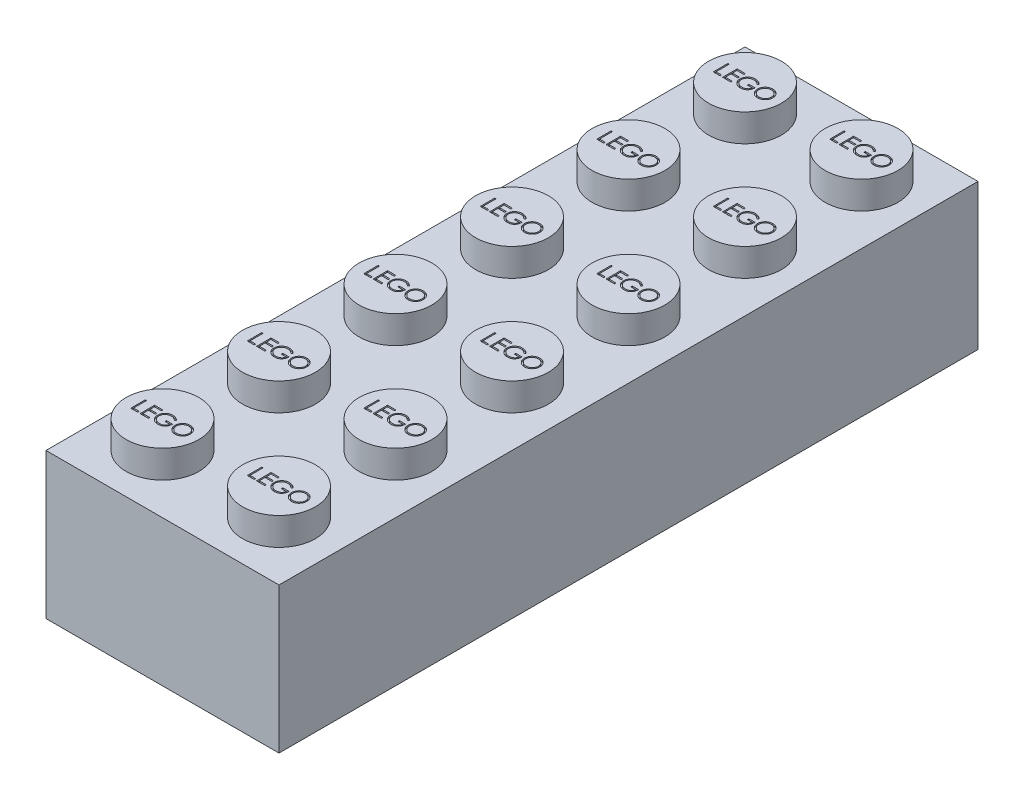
from build123d import *

# Parameters (mm, degrees)
ESBO_O1_W                   = 16
ESBO_O1_H                   = 16
RESSALTO_EXTRUS_O1_DEPTH    = 10
ESBO_O2_R                   = 2.5
RESSALTO_EXTRUS_O2_DEPTH    = 1.9
ESBO_O3_W                   = 14
ESBO_O3_H                   = 14
ESBO_O3_R                   = 3.5
ESBO_O3_R_2                 = 2.5
CORTE_EXTRUS_O1_DEPTH       = 9
CORTE_EXTRUS_O2_DEPTH       = 0.1
PADR_O_LINEAR1_COUNT        = 2
PADR_O_LINEAR1_PITCH        = 8
PADR_O_LINEAR2_COUNT        = 2
PADR_O_LINEAR2_PITCH        = 8
PADR_O_LINEAR2_COPY_1_DEPTH = 0.1
PADR_O_LINEAR3_COUNT        = 3
PADR_O_LINEAR3_PITCH        = 16
PADR_O_LINEAR3_COPY_1_DEPTH = 0.1
PADR_O_LINEAR3_COPY_2_DEPTH = 0.1
PADR_O_LINEAR3_COPY_3_DEPTH = 0.1
PADR_O_LINEAR3_COPY_4_DEPTH = 0.1
PADR_O_LINEAR3_COPY_5_DEPTH = 0.1
PADR_O_LINEAR3_COPY_6_DEPTH = 0.1
ESBO_O7_W                   = 14
ESBO_O7_H                   = 2
CORTE_EXTRUS_O3_DEPTH       = 9


with BuildPart() as part:
    # Esbo_o1 → Ressalto-extrus_o1 (new body)
    with BuildSketch(Plane(origin=(0, 0, 0), x_dir=(1, 0, 0), z_dir=(0, 1, 0))):
        with Locations((8, 8)):
            Rectangle(ESBO_O1_W, ESBO_O1_H)
    ressalto_extrus_o1 = extrude(amount=RESSALTO_EXTRUS_O1_DEPTH)

    # Esbo_o2 → Ressalto-extrus_o2 (add)
    with BuildSketch(Plane(origin=(0, 10, 0), x_dir=(1, 0, 0), z_dir=(0, 1, 0))):
        with Locations(Location((4, 4, 0), (0, 0, 90))):
            Circle(ESBO_O2_R)
        with Locations(Location((4, 12, 0), (0, 0, 90))):
            Circle(ESBO_O2_R)
        with Locations(Location((12, 12, 0), (0, 0, 90))):
            Circle(ESBO_O2_R)
        with Locations(Location((12, 4, 0), (0, 0, 90))):
            Circle(ESBO_O2_R)
    ressalto_extrus_o2 = extrude(amount=RESSALTO_EXTRUS_O2_DEPTH)

    # Esbo_o3 → Corte-extrus_o1 (cut)
    # profile 1 of 2: a face of its own
    with BuildSketch(Plane.XZ):
        with Locations((8, -8)):
            Rectangle(ESBO_O3_W, ESBO_O3_H)
        with Locations(Location((8, -8, 0), (0, 0, 270))):
            Circle(ESBO_O3_R, mode=Mode.SUBTRACT)
    # profile 2 of 2: a face of its own
    with BuildSketch(Plane.XZ):
        with Locations(Location((8, -8, 0), (0, 0, 270))):
            Circle(ESBO_O3_R_2)
    corte_extrus_o1 = extrude(amount=-CORTE_EXTRUS_O1_DEPTH, mode=Mode.SUBTRACT)

    # Esbo_o6 → Corte-extrus_o2 (cut)
    # profile 1 of 4: a face of its own
    with BuildSketch(Plane(origin=(0, 11.9, 0), x_dir=(1, 0, 0), z_dir=(0, 1, 0))):
        Polygon((2.297037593, 12.522294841), (2.386781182, 12.522294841), (2.386781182, 11.624858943), (2.771396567, 11.624858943), (2.771396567, 11.522294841), (2.297037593, 11.522294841), align=None)
    # profile 2 of 4: a face of its own
    with BuildSketch(Plane(origin=(0, 11.9, 0), x_dir=(1, 0, 0), z_dir=(0, 1, 0))):
        Polygon((2.938063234, 12.522294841), (3.502165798, 12.522294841), (3.502165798, 12.419730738), (3.027806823, 12.419730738), (3.027806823, 12.112038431), (3.502165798, 12.112038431), (3.502165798, 12.009474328), (3.027806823, 12.009474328), (3.027806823, 11.624858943), (3.502165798, 11.624858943), (3.502165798, 11.522294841), (2.938063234, 11.522294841), align=None)
    # profile 3 of 4: a face of its own
    with BuildSketch(Plane(origin=(0, 11.9, 0), x_dir=(1, 0, 0), z_dir=(0, 1, 0))):
        with BuildLine():
            Line((4.617550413, 12.351621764), (4.540627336, 12.278705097))
            add(Edge.make_bspline(
                [(4.540627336, 12.278705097), (4.526707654, 12.29179963), (4.499200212, 12.317676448), (4.454354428, 12.351251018), (4.407564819, 12.38001276), (4.359075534, 12.403414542), (4.310087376, 12.42208676), (4.261250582, 12.435380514), (4.213066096, 12.443858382), (4.18101832, 12.444872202), (4.165226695, 12.445371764)],
                knots=[0, 0, 0, 0, 1.08915593, 2.152340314, 3.188132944, 4.216796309, 5.218260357, 6.173443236, 7.099959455, 8, 8, 8, 8], degree=3))
            add(Edge.make_bspline(
                [(4.165226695, 12.445371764), (4.155536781, 12.445253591), (4.136182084, 12.445017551), (4.107432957, 12.442004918), (4.078985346, 12.4376721), (4.050892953, 12.431402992), (4.023101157, 12.423457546), (3.995706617, 12.413518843), (3.96865823, 12.40193163), (3.942210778, 12.388542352), (3.916570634, 12.373833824), (3.892354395, 12.357534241), (3.86940771, 12.340166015), (3.848161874, 12.321294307), (3.828494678, 12.30109006), (3.809938, 12.279929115), (3.793144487, 12.257233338), (3.777975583, 12.233420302), (3.764443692, 12.208908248), (3.752498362, 12.183933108), (3.742470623, 12.158577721), (3.734536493, 12.132810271), (3.727990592, 12.106830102), (3.723385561, 12.080457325), (3.720789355, 12.053663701), (3.720340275, 12.035721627), (3.720114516, 12.026701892)],
                knots=[0, 0, 0, 0, 1.02818874, 2.053710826, 3.065248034, 4.081641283, 5.106893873, 6.131558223, 7.173050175, 8.228653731, 9.27666206, 10.308777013, 11.325269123, 12.329503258, 13.32196095, 14.316845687, 15.314881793, 16.315733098, 17.311955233, 18.285320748, 19.252783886, 20.203351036, 21.145449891, 22.095197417, 23.042428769, 24, 24, 24, 24], degree=3))
            add(Edge.make_bspline(
                [(3.720114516, 12.026701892), (3.720330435, 12.017481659), (3.720761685, 11.999066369), (3.723521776, 11.971582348), (3.72864413, 11.944506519), (3.735492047, 11.91774991), (3.744057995, 11.891266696), (3.754735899, 11.865171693), (3.767383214, 11.839465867), (3.782022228, 11.814380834), (3.798075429, 11.789945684), (3.816059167, 11.766928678), (3.835162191, 11.745023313), (3.856080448, 11.724715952), (3.878143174, 11.70546341), (3.902009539, 11.687796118), (3.927210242, 11.671373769), (3.953783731, 11.656403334), (3.981441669, 11.643029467), (4.009800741, 11.631136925), (4.038951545, 11.621342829), (4.068740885, 11.613360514), (4.099133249, 11.606817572), (4.130282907, 11.602608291), (4.161960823, 11.599553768), (4.183314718, 11.599330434), (4.194072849, 11.599217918)],
                knots=[0, 0, 0, 0, 0.93586088, 1.869166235, 2.799637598, 3.729985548, 4.670839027, 5.622275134, 6.589130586, 7.576015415, 8.568469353, 9.55398029, 10.53834874, 11.515998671, 12.510579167, 13.508179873, 14.527009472, 15.561807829, 16.601455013, 17.643573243, 18.680854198, 19.719860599, 20.772568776, 21.833555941, 22.908541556, 24, 24, 24, 24], degree=3))
            add(Edge.make_bspline(
                [(4.194072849, 11.599217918), (4.207038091, 11.59948894), (4.23249745, 11.600021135), (4.269922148, 11.604164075), (4.305865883, 11.610634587), (4.340227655, 11.620110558), (4.373047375, 11.632197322), (4.404445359, 11.646767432), (4.434174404, 11.664379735), (4.462323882, 11.684257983), (4.488254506, 11.706405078), (4.511641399, 11.730303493), (4.532111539, 11.755837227), (4.549970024, 11.782855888), (4.564743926, 11.811583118), (4.576870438, 11.841878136), (4.586165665, 11.873754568), (4.589981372, 11.895780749), (4.591909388, 11.906910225)],
                knots=[0, 0, 0, 0, 1.13008108, 2.219097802, 3.278683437, 4.311054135, 5.322181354, 6.324827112, 7.324222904, 8.330512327, 9.32562643, 10.293043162, 11.24128371, 12.174520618, 13.111833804, 14.052305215, 15.015860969, 16, 16, 16, 16], degree=3))
            Line((4.591909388, 11.906910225), (4.258576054, 11.906910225))
            Line((4.258576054, 11.906910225), (4.258576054, 12.009474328))
            Line((4.258576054, 12.009474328), (4.681652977, 12.009474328))
            add(Edge.make_bspline(
                [(4.681652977, 12.009474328), (4.681165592, 11.990357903), (4.680211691, 11.952943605), (4.673520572, 11.89838067), (4.662715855, 11.846845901), (4.647955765, 11.798285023), (4.628848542, 11.752766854), (4.605599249, 11.710245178), (4.577835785, 11.670994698), (4.546547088, 11.634694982), (4.511432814, 11.602315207), (4.47344178, 11.573856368), (4.432511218, 11.549884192), (4.388679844, 11.530381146), (4.342091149, 11.515160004), (4.292637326, 11.504368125), (4.24038544, 11.497902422), (4.204574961, 11.497076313), (4.186260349, 11.496653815)],
                knots=[0, 0, 0, 0, 1.140356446, 2.231883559, 3.274166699, 4.278491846, 5.25512956, 6.21435461, 7.1637429, 8.11826594, 9.068280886, 10.0076534, 10.945064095, 11.891975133, 12.864533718, 13.863980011, 14.907571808, 16, 16, 16, 16], degree=3))
            add(Edge.make_bspline(
                [(4.186260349, 11.496653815), (4.174971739, 11.496816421), (4.152706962, 11.497137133), (4.119823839, 11.499416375), (4.087847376, 11.502925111), (4.056782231, 11.508223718), (4.026514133, 11.514713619), (3.997194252, 11.52302411), (3.968710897, 11.532643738), (3.941020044, 11.543585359), (3.91437303, 11.556262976), (3.888651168, 11.570351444), (3.863712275, 11.585778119), (3.839726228, 11.602809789), (3.816568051, 11.621319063), (3.794387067, 11.64134304), (3.773059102, 11.662820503), (3.759698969, 11.678071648), (3.75296708, 11.685756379)],
                knots=[0, 0, 0, 0, 1.107784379, 2.184907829, 3.233506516, 4.263428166, 5.276301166, 6.270063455, 7.25232949, 8.225834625, 9.190232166, 10.146266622, 11.1027726, 12.066435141, 13.031522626, 14.010570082, 14.99756817, 16, 16, 16, 16], degree=3))
            add(Edge.make_bspline(
                [(3.75296708, 11.685756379), (3.743199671, 11.697947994), (3.723826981, 11.722128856), (3.698890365, 11.760871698), (3.677632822, 11.800986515), (3.660384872, 11.84258498), (3.646916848, 11.885628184), (3.637257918, 11.930061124), (3.631598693, 11.975941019), (3.630783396, 12.006988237), (3.630370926, 12.022695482)],
                knots=[0, 0, 0, 0, 1.023165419, 2.029347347, 3.013907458, 3.994755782, 4.975994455, 5.96558838, 6.970761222, 8, 8, 8, 8], degree=3))
            add(Edge.make_bspline(
                [(3.630370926, 12.022695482), (3.630522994, 12.034457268), (3.630825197, 12.057831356), (3.634489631, 12.092533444), (3.639747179, 12.126619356), (3.647474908, 12.160061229), (3.657216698, 12.192881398), (3.669374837, 12.225095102), (3.683530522, 12.256721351), (3.699983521, 12.287542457), (3.718293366, 12.317149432), (3.738164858, 12.34542309), (3.759880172, 12.371848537), (3.783084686, 12.396760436), (3.808055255, 12.419845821), (3.834557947, 12.441318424), (3.862613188, 12.461207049), (3.89230924, 12.47919843), (3.923202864, 12.495359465), (3.955220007, 12.509527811), (3.988350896, 12.521237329), (4.022347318, 12.531172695), (4.057466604, 12.538519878), (4.0934539, 12.543848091), (4.130496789, 12.547493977), (4.155535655, 12.547787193), (4.168231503, 12.547935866)],
                knots=[0, 0, 0, 0, 1.008945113, 2.00506715, 2.99143336, 3.967273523, 4.948097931, 5.927297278, 6.919902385, 7.919676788, 8.923139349, 9.905703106, 10.883022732, 11.856032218, 12.825136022, 13.798837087, 14.781400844, 15.773989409, 16.776158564, 17.77167057, 18.775803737, 19.789618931, 20.80898985, 21.851988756, 22.910860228, 24, 24, 24, 24], degree=3))
            add(Edge.make_bspline(
                [(4.168231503, 12.547935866), (4.178585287, 12.547770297), (4.199115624, 12.547441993), (4.229665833, 12.54516638), (4.259743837, 12.541559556), (4.289394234, 12.536637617), (4.318516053, 12.529933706), (4.347192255, 12.521911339), (4.375464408, 12.512570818), (4.403243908, 12.501431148), (4.430717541, 12.488787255), (4.458038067, 12.474554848), (4.485112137, 12.458490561), (4.511986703, 12.440546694), (4.538831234, 12.421031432), (4.565221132, 12.399386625), (4.591793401, 12.376465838), (4.608879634, 12.359985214), (4.617550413, 12.351621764)],
                knots=[0, 0, 0, 0, 0.985871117, 1.954866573, 2.915460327, 3.869826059, 4.81536089, 5.759505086, 6.70452669, 7.649098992, 8.607881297, 9.583363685, 10.581137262, 11.603961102, 12.659522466, 13.73993555, 14.853081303, 16, 16, 16, 16], degree=3))
        make_face()
    # profile 4 of 4: a face of its own
    with BuildSketch(Plane(origin=(0, 11.9, 0), x_dir=(1, 0, 0), z_dir=(0, 1, 0))):
        with BuildLine():
            add(Edge.make_bspline(
                [(5.3547299, 12.547935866), (5.373246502, 12.547466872), (5.409614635, 12.546545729), (5.463064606, 12.539494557), (5.514091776, 12.527295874), (5.563111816, 12.511049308), (5.609538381, 12.489376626), (5.653720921, 12.463180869), (5.695554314, 12.432187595), (5.734474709, 12.396636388), (5.77009098, 12.357955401), (5.801469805, 12.316675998), (5.827767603, 12.273047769), (5.849363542, 12.227201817), (5.866306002, 12.179241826), (5.877997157, 12.128912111), (5.8854652, 12.076538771), (5.88633828, 12.04081681), (5.886781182, 12.022695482)],
                knots=[0, 0, 0, 0, 1.065120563, 2.091984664, 3.0946048, 4.079830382, 5.057816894, 6.036188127, 7.030412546, 8.04752943, 9.064399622, 10.05169764, 11.02544977, 11.989514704, 12.962713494, 13.945757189, 14.957906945, 16, 16, 16, 16], degree=3))
            add(Edge.make_bspline(
                [(5.886781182, 12.022695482), (5.886338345, 12.00470764), (5.88546546, 11.96925152), (5.877988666, 11.917210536), (5.866262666, 11.867184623), (5.849520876, 11.819257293), (5.828027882, 11.773377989), (5.801554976, 11.729667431), (5.770371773, 11.688111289), (5.734884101, 11.649164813), (5.696198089, 11.61345125), (5.654703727, 11.582331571), (5.611334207, 11.55555325), (5.565531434, 11.534186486), (5.517902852, 11.517108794), (5.468022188, 11.505465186), (5.416123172, 11.497954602), (5.380731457, 11.497092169), (5.362742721, 11.496653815)],
                knots=[0, 0, 0, 0, 1.043624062, 2.057103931, 3.04512605, 4.022047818, 4.998200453, 5.980619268, 6.982898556, 8.009068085, 9.034988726, 10.034168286, 11.015286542, 11.987931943, 12.962482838, 13.94673481, 14.956375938, 16, 16, 16, 16], degree=3))
            add(Edge.make_bspline(
                [(5.362742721, 11.496653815), (5.344621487, 11.497096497), (5.308899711, 11.497969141), (5.256460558, 11.505449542), (5.206095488, 11.517147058), (5.157948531, 11.53386404), (5.111992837, 11.555468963), (5.068138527, 11.581813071), (5.026561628, 11.613072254), (4.987606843, 11.648548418), (4.951964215, 11.687168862), (4.920890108, 11.728550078), (4.894540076, 11.771880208), (4.873007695, 11.817279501), (4.855960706, 11.864528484), (4.844330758, 11.913942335), (4.836806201, 11.965239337), (4.835939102, 12.000165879), (4.835499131, 12.01788779)],
                knots=[0, 0, 0, 0, 1.053102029, 2.075944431, 3.073151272, 4.055350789, 5.033113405, 6.020478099, 7.024410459, 8.052272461, 9.079885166, 10.07527673, 11.055994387, 12.023226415, 12.992069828, 13.970394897, 14.97016774, 16, 16, 16, 16], degree=3))
            add(Edge.make_bspline(
                [(4.835499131, 12.01788779), (4.835651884, 12.029782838), (4.835955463, 12.053422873), (4.839610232, 12.088527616), (4.844913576, 12.123067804), (4.852514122, 12.156945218), (4.862454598, 12.190076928), (4.874183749, 12.222691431), (4.888509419, 12.254458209), (4.90470389, 12.28552775), (4.922778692, 12.315415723), (4.942743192, 12.343667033), (4.963896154, 12.370518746), (4.987085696, 12.395275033), (5.011547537, 12.418656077), (5.037678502, 12.440302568), (5.065319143, 12.460409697), (5.094588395, 12.478529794), (5.124765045, 12.494918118), (5.155872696, 12.508981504), (5.187488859, 12.521051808), (5.219761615, 12.530834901), (5.252605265, 12.53855834), (5.286091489, 12.543817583), (5.320193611, 12.547481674), (5.343168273, 12.547783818), (5.3547299, 12.547935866)],
                knots=[0, 0, 0, 0, 1.037015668, 2.060948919, 3.074880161, 4.083647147, 5.086022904, 6.090072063, 7.104153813, 8.122640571, 9.144368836, 10.147691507, 11.138137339, 12.123020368, 13.103399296, 14.087645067, 15.080126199, 16.082011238, 17.087798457, 18.072939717, 19.057185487, 20.037253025, 21.01195951, 21.997135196, 22.992090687, 24, 24, 24, 24], degree=3))
        make_face()
        with BuildLine():
            add(Edge.make_bspline(
                [(5.359136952, 12.445371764), (5.349647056, 12.445256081), (5.33075799, 12.445025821), (5.302676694, 12.441992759), (5.274964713, 12.437669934), (5.247616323, 12.431503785), (5.220745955, 12.423102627), (5.194103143, 12.413433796), (5.167930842, 12.401656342), (5.142315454, 12.388349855), (5.117482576, 12.373621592), (5.094050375, 12.357343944), (5.071958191, 12.339898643), (5.051260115, 12.321244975), (5.032016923, 12.301287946), (5.013849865, 12.280330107), (4.997487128, 12.257772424), (4.982491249, 12.234226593), (4.969071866, 12.209723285), (4.957138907, 12.184520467), (4.947377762, 12.158412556), (4.939417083, 12.131682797), (4.932817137, 12.104373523), (4.928636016, 12.076277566), (4.925569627, 12.047536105), (4.925352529, 12.028112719), (4.925242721, 12.018288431)],
                knots=[0, 0, 0, 0, 1.008559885, 2.007477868, 2.99961109, 3.989939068, 4.984837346, 5.991145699, 7.001802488, 8.033829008, 9.059044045, 10.069351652, 11.065060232, 12.050310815, 13.029377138, 14.011219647, 14.996725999, 15.989392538, 16.977580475, 17.965360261, 18.951710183, 19.937753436, 20.929683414, 21.935841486, 22.955955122, 24, 24, 24, 24], degree=3))
            add(Edge.make_bspline(
                [(4.925242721, 12.018288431), (4.925606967, 12.003842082), (4.926323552, 11.975421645), (4.932597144, 11.933773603), (4.942260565, 11.893748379), (4.956505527, 11.855564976), (4.974319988, 11.818895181), (4.996327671, 11.784064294), (5.022401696, 11.751062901), (5.052019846, 11.720121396), (5.084397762, 11.691879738), (5.118778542, 11.667090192), (5.154793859, 11.646115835), (5.192537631, 11.629028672), (5.231808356, 11.615488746), (5.272859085, 11.606209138), (5.315416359, 11.600101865), (5.344425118, 11.599515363), (5.359136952, 11.599217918)],
                knots=[0, 0, 0, 0, 1.032063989, 2.030389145, 3.003944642, 3.970395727, 4.937377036, 5.913328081, 6.909231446, 7.93887556, 8.970685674, 9.976071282, 10.964166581, 11.944589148, 12.933237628, 13.927779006, 14.949070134, 16, 16, 16, 16], degree=3))
            add(Edge.make_bspline(
                [(5.359136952, 11.599217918), (5.369025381, 11.599353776), (5.388637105, 11.599623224), (5.417807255, 11.602337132), (5.446451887, 11.606689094), (5.474530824, 11.612954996), (5.502012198, 11.620797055), (5.529010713, 11.630113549), (5.555238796, 11.64173675), (5.581027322, 11.654579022), (5.605711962, 11.669219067), (5.6292764, 11.684944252), (5.65112668, 11.702363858), (5.671809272, 11.720740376), (5.691131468, 11.740444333), (5.708962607, 11.76145011), (5.725242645, 11.783890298), (5.740232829, 11.807400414), (5.75360519, 11.831970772), (5.765256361, 11.857264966), (5.775140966, 11.883220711), (5.783120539, 11.909875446), (5.789373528, 11.937178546), (5.793682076, 11.965166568), (5.796695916, 11.993783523), (5.796923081, 12.01313891), (5.797037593, 12.022895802)],
                knots=[0, 0, 0, 0, 1.047197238, 2.076906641, 3.100256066, 4.114471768, 5.12198147, 6.126382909, 7.136867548, 8.15857795, 9.17633901, 10.174870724, 11.156907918, 12.133735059, 13.104061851, 14.077631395, 15.04955518, 16.038496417, 17.029181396, 18.010275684, 18.986308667, 19.968651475, 20.955262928, 21.950658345, 22.966943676, 24, 24, 24, 24], degree=3))
            add(Edge.make_bspline(
                [(5.797037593, 12.022895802), (5.796922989, 12.032585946), (5.796695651, 12.051808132), (5.793683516, 12.080225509), (5.789368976, 12.108012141), (5.783151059, 12.135058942), (5.775136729, 12.161372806), (5.765254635, 12.18692902), (5.753601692, 12.21182279), (5.740227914, 12.235992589), (5.725194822, 12.259185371), (5.708767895, 12.281357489), (5.69066351, 12.302092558), (5.671398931, 12.32190247), (5.650492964, 12.340364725), (5.628040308, 12.357485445), (5.604313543, 12.373677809), (5.579191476, 12.388285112), (5.553264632, 12.401774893), (5.526660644, 12.413332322), (5.499680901, 12.423152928), (5.472394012, 12.431529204), (5.444570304, 12.437645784), (5.416397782, 12.441996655), (5.387915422, 12.445024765), (5.368760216, 12.445255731), (5.359136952, 12.445371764)],
                knots=[0, 0, 0, 0, 1.02996197, 2.043119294, 3.035359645, 4.018872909, 4.991431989, 5.957985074, 6.929999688, 7.912076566, 8.892894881, 9.867085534, 10.843653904, 11.817741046, 12.803660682, 13.806313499, 14.818574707, 15.856120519, 16.894564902, 17.924820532, 18.937903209, 19.946497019, 20.957711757, 21.963978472, 22.977135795, 24, 24, 24, 24], degree=3))
        make_face(mode=Mode.SUBTRACT)
    corte_extrus_o2 = extrude(amount=-CORTE_EXTRUS_O2_DEPTH, mode=Mode.SUBTRACT)

    # Padr_o linear1: Corte-extrus_o2 ×2
    with Locations(*[(0, 0, i * PADR_O_LINEAR1_PITCH) for i in range(1, PADR_O_LINEAR1_COUNT)]):
        add(corte_extrus_o2, mode=Mode.SUBTRACT)

    # Padr_o linear2: Corte-extrus_o2 ×2
    with Locations(*[(i * PADR_O_LINEAR2_PITCH, 0, 0) for i in range(1, PADR_O_LINEAR2_COUNT)]):
        add(corte_extrus_o2, mode=Mode.SUBTRACT)

    # Padr_o linear2 copy 1 sketch → Padr_o linear2 copy 1 (cut)
    # profile 1 of 4: a face of its own
    with BuildSketch(Plane(origin=(8, 11.9, 8), x_dir=(1, 0, 0), z_dir=(0, 1, 0))):
        Polygon((2.297037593, 12.522294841), (2.386781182, 12.522294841), (2.386781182, 11.624858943), (2.771396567, 11.624858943), (2.771396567, 11.522294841), (2.297037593, 11.522294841), align=None)
    # profile 2 of 4: a face of its own
    with BuildSketch(Plane(origin=(8, 11.9, 8), x_dir=(1, 0, 0), z_dir=(0, 1, 0))):
        Polygon((2.938063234, 12.522294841), (3.502165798, 12.522294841), (3.502165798, 12.419730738), (3.027806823, 12.419730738), (3.027806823, 12.112038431), (3.502165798, 12.112038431), (3.502165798, 12.009474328), (3.027806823, 12.009474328), (3.027806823, 11.624858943), (3.502165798, 11.624858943), (3.502165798, 11.522294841), (2.938063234, 11.522294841), align=None)
    # profile 3 of 4: a face of its own
    with BuildSketch(Plane(origin=(8, 11.9, 8), x_dir=(1, 0, 0), z_dir=(0, 1, 0))):
        with BuildLine():
            Line((4.617550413, 12.351621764), (4.540627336, 12.278705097))
            add(Edge.make_bspline(
                [(4.540627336, 12.278705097), (4.526707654, 12.29179963), (4.499200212, 12.317676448), (4.454354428, 12.351251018), (4.407564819, 12.38001276), (4.359075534, 12.403414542), (4.310087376, 12.42208676), (4.261250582, 12.435380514), (4.213066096, 12.443858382), (4.18101832, 12.444872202), (4.165226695, 12.445371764)],
                knots=[0, 0, 0, 0, 1.08915593, 2.152340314, 3.188132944, 4.216796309, 5.218260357, 6.173443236, 7.099959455, 8, 8, 8, 8], degree=3))
            add(Edge.make_bspline(
                [(4.165226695, 12.445371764), (4.155536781, 12.445253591), (4.136182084, 12.445017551), (4.107432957, 12.442004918), (4.078985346, 12.4376721), (4.050892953, 12.431402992), (4.023101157, 12.423457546), (3.995706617, 12.413518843), (3.96865823, 12.40193163), (3.942210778, 12.388542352), (3.916570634, 12.373833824), (3.892354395, 12.357534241), (3.86940771, 12.340166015), (3.848161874, 12.321294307), (3.828494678, 12.30109006), (3.809938, 12.279929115), (3.793144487, 12.257233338), (3.777975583, 12.233420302), (3.764443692, 12.208908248), (3.752498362, 12.183933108), (3.742470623, 12.158577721), (3.734536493, 12.132810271), (3.727990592, 12.106830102), (3.723385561, 12.080457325), (3.720789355, 12.053663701), (3.720340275, 12.035721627), (3.720114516, 12.026701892)],
                knots=[0, 0, 0, 0, 1.02818874, 2.053710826, 3.065248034, 4.081641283, 5.106893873, 6.131558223, 7.173050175, 8.228653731, 9.27666206, 10.308777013, 11.325269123, 12.329503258, 13.32196095, 14.316845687, 15.314881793, 16.315733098, 17.311955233, 18.285320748, 19.252783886, 20.203351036, 21.145449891, 22.095197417, 23.042428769, 24, 24, 24, 24], degree=3))
            add(Edge.make_bspline(
                [(3.720114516, 12.026701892), (3.720330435, 12.017481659), (3.720761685, 11.999066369), (3.723521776, 11.971582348), (3.72864413, 11.944506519), (3.735492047, 11.91774991), (3.744057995, 11.891266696), (3.754735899, 11.865171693), (3.767383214, 11.839465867), (3.782022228, 11.814380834), (3.798075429, 11.789945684), (3.816059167, 11.766928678), (3.835162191, 11.745023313), (3.856080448, 11.724715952), (3.878143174, 11.70546341), (3.902009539, 11.687796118), (3.927210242, 11.671373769), (3.953783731, 11.656403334), (3.981441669, 11.643029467), (4.009800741, 11.631136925), (4.038951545, 11.621342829), (4.068740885, 11.613360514), (4.099133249, 11.606817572), (4.130282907, 11.602608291), (4.161960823, 11.599553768), (4.183314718, 11.599330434), (4.194072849, 11.599217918)],
                knots=[0, 0, 0, 0, 0.93586088, 1.869166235, 2.799637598, 3.729985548, 4.670839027, 5.622275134, 6.589130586, 7.576015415, 8.568469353, 9.55398029, 10.53834874, 11.515998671, 12.510579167, 13.508179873, 14.527009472, 15.561807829, 16.601455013, 17.643573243, 18.680854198, 19.719860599, 20.772568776, 21.833555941, 22.908541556, 24, 24, 24, 24], degree=3))
            add(Edge.make_bspline(
                [(4.194072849, 11.599217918), (4.207038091, 11.59948894), (4.23249745, 11.600021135), (4.269922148, 11.604164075), (4.305865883, 11.610634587), (4.340227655, 11.620110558), (4.373047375, 11.632197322), (4.404445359, 11.646767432), (4.434174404, 11.664379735), (4.462323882, 11.684257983), (4.488254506, 11.706405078), (4.511641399, 11.730303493), (4.532111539, 11.755837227), (4.549970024, 11.782855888), (4.564743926, 11.811583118), (4.576870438, 11.841878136), (4.586165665, 11.873754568), (4.589981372, 11.895780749), (4.591909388, 11.906910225)],
                knots=[0, 0, 0, 0, 1.13008108, 2.219097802, 3.278683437, 4.311054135, 5.322181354, 6.324827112, 7.324222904, 8.330512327, 9.32562643, 10.293043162, 11.24128371, 12.174520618, 13.111833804, 14.052305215, 15.015860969, 16, 16, 16, 16], degree=3))
            Line((4.591909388, 11.906910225), (4.258576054, 11.906910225))
            Line((4.258576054, 11.906910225), (4.258576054, 12.009474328))
            Line((4.258576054, 12.009474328), (4.681652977, 12.009474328))
            add(Edge.make_bspline(
                [(4.681652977, 12.009474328), (4.681165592, 11.990357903), (4.680211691, 11.952943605), (4.673520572, 11.89838067), (4.662715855, 11.846845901), (4.647955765, 11.798285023), (4.628848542, 11.752766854), (4.605599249, 11.710245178), (4.577835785, 11.670994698), (4.546547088, 11.634694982), (4.511432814, 11.602315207), (4.47344178, 11.573856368), (4.432511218, 11.549884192), (4.388679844, 11.530381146), (4.342091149, 11.515160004), (4.292637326, 11.504368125), (4.24038544, 11.497902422), (4.204574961, 11.497076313), (4.186260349, 11.496653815)],
                knots=[0, 0, 0, 0, 1.140356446, 2.231883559, 3.274166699, 4.278491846, 5.25512956, 6.21435461, 7.1637429, 8.11826594, 9.068280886, 10.0076534, 10.945064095, 11.891975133, 12.864533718, 13.863980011, 14.907571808, 16, 16, 16, 16], degree=3))
            add(Edge.make_bspline(
                [(4.186260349, 11.496653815), (4.174971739, 11.496816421), (4.152706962, 11.497137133), (4.119823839, 11.499416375), (4.087847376, 11.502925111), (4.056782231, 11.508223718), (4.026514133, 11.514713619), (3.997194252, 11.52302411), (3.968710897, 11.532643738), (3.941020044, 11.543585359), (3.91437303, 11.556262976), (3.888651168, 11.570351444), (3.863712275, 11.585778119), (3.839726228, 11.602809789), (3.816568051, 11.621319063), (3.794387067, 11.64134304), (3.773059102, 11.662820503), (3.759698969, 11.678071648), (3.75296708, 11.685756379)],
                knots=[0, 0, 0, 0, 1.107784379, 2.184907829, 3.233506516, 4.263428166, 5.276301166, 6.270063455, 7.25232949, 8.225834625, 9.190232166, 10.146266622, 11.1027726, 12.066435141, 13.031522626, 14.010570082, 14.99756817, 16, 16, 16, 16], degree=3))
            add(Edge.make_bspline(
                [(3.75296708, 11.685756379), (3.743199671, 11.697947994), (3.723826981, 11.722128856), (3.698890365, 11.760871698), (3.677632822, 11.800986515), (3.660384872, 11.84258498), (3.646916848, 11.885628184), (3.637257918, 11.930061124), (3.631598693, 11.975941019), (3.630783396, 12.006988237), (3.630370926, 12.022695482)],
                knots=[0, 0, 0, 0, 1.023165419, 2.029347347, 3.013907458, 3.994755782, 4.975994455, 5.96558838, 6.970761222, 8, 8, 8, 8], degree=3))
            add(Edge.make_bspline(
                [(3.630370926, 12.022695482), (3.630522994, 12.034457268), (3.630825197, 12.057831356), (3.634489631, 12.092533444), (3.639747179, 12.126619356), (3.647474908, 12.160061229), (3.657216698, 12.192881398), (3.669374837, 12.225095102), (3.683530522, 12.256721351), (3.699983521, 12.287542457), (3.718293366, 12.317149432), (3.738164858, 12.34542309), (3.759880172, 12.371848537), (3.783084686, 12.396760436), (3.808055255, 12.419845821), (3.834557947, 12.441318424), (3.862613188, 12.461207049), (3.89230924, 12.47919843), (3.923202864, 12.495359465), (3.955220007, 12.509527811), (3.988350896, 12.521237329), (4.022347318, 12.531172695), (4.057466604, 12.538519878), (4.0934539, 12.543848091), (4.130496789, 12.547493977), (4.155535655, 12.547787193), (4.168231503, 12.547935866)],
                knots=[0, 0, 0, 0, 1.008945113, 2.00506715, 2.99143336, 3.967273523, 4.948097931, 5.927297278, 6.919902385, 7.919676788, 8.923139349, 9.905703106, 10.883022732, 11.856032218, 12.825136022, 13.798837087, 14.781400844, 15.773989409, 16.776158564, 17.77167057, 18.775803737, 19.789618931, 20.80898985, 21.851988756, 22.910860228, 24, 24, 24, 24], degree=3))
            add(Edge.make_bspline(
                [(4.168231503, 12.547935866), (4.178585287, 12.547770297), (4.199115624, 12.547441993), (4.229665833, 12.54516638), (4.259743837, 12.541559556), (4.289394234, 12.536637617), (4.318516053, 12.529933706), (4.347192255, 12.521911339), (4.375464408, 12.512570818), (4.403243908, 12.501431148), (4.430717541, 12.488787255), (4.458038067, 12.474554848), (4.485112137, 12.458490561), (4.511986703, 12.440546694), (4.538831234, 12.421031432), (4.565221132, 12.399386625), (4.591793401, 12.376465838), (4.608879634, 12.359985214), (4.617550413, 12.351621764)],
                knots=[0, 0, 0, 0, 0.985871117, 1.954866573, 2.915460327, 3.869826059, 4.81536089, 5.759505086, 6.70452669, 7.649098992, 8.607881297, 9.583363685, 10.581137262, 11.603961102, 12.659522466, 13.73993555, 14.853081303, 16, 16, 16, 16], degree=3))
        make_face()
    # profile 4 of 4: a face of its own
    with BuildSketch(Plane(origin=(8, 11.9, 8), x_dir=(1, 0, 0), z_dir=(0, 1, 0))):
        with BuildLine():
            add(Edge.make_bspline(
                [(5.3547299, 12.547935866), (5.373246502, 12.547466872), (5.409614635, 12.546545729), (5.463064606, 12.539494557), (5.514091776, 12.527295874), (5.563111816, 12.511049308), (5.609538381, 12.489376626), (5.653720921, 12.463180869), (5.695554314, 12.432187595), (5.734474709, 12.396636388), (5.77009098, 12.357955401), (5.801469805, 12.316675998), (5.827767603, 12.273047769), (5.849363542, 12.227201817), (5.866306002, 12.179241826), (5.877997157, 12.128912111), (5.8854652, 12.076538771), (5.88633828, 12.04081681), (5.886781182, 12.022695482)],
                knots=[0, 0, 0, 0, 1.065120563, 2.091984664, 3.0946048, 4.079830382, 5.057816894, 6.036188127, 7.030412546, 8.04752943, 9.064399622, 10.05169764, 11.02544977, 11.989514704, 12.962713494, 13.945757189, 14.957906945, 16, 16, 16, 16], degree=3))
            add(Edge.make_bspline(
                [(5.886781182, 12.022695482), (5.886338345, 12.00470764), (5.88546546, 11.96925152), (5.877988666, 11.917210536), (5.866262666, 11.867184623), (5.849520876, 11.819257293), (5.828027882, 11.773377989), (5.801554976, 11.729667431), (5.770371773, 11.688111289), (5.734884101, 11.649164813), (5.696198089, 11.61345125), (5.654703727, 11.582331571), (5.611334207, 11.55555325), (5.565531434, 11.534186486), (5.517902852, 11.517108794), (5.468022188, 11.505465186), (5.416123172, 11.497954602), (5.380731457, 11.497092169), (5.362742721, 11.496653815)],
                knots=[0, 0, 0, 0, 1.043624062, 2.057103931, 3.04512605, 4.022047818, 4.998200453, 5.980619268, 6.982898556, 8.009068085, 9.034988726, 10.034168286, 11.015286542, 11.987931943, 12.962482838, 13.94673481, 14.956375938, 16, 16, 16, 16], degree=3))
            add(Edge.make_bspline(
                [(5.362742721, 11.496653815), (5.344621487, 11.497096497), (5.308899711, 11.497969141), (5.256460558, 11.505449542), (5.206095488, 11.517147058), (5.157948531, 11.53386404), (5.111992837, 11.555468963), (5.068138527, 11.581813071), (5.026561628, 11.613072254), (4.987606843, 11.648548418), (4.951964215, 11.687168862), (4.920890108, 11.728550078), (4.894540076, 11.771880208), (4.873007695, 11.817279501), (4.855960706, 11.864528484), (4.844330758, 11.913942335), (4.836806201, 11.965239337), (4.835939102, 12.000165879), (4.835499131, 12.01788779)],
                knots=[0, 0, 0, 0, 1.053102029, 2.075944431, 3.073151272, 4.055350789, 5.033113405, 6.020478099, 7.024410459, 8.052272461, 9.079885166, 10.07527673, 11.055994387, 12.023226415, 12.992069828, 13.970394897, 14.97016774, 16, 16, 16, 16], degree=3))
            add(Edge.make_bspline(
                [(4.835499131, 12.01788779), (4.835651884, 12.029782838), (4.835955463, 12.053422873), (4.839610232, 12.088527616), (4.844913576, 12.123067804), (4.852514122, 12.156945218), (4.862454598, 12.190076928), (4.874183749, 12.222691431), (4.888509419, 12.254458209), (4.90470389, 12.28552775), (4.922778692, 12.315415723), (4.942743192, 12.343667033), (4.963896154, 12.370518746), (4.987085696, 12.395275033), (5.011547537, 12.418656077), (5.037678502, 12.440302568), (5.065319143, 12.460409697), (5.094588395, 12.478529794), (5.124765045, 12.494918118), (5.155872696, 12.508981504), (5.187488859, 12.521051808), (5.219761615, 12.530834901), (5.252605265, 12.53855834), (5.286091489, 12.543817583), (5.320193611, 12.547481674), (5.343168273, 12.547783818), (5.3547299, 12.547935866)],
                knots=[0, 0, 0, 0, 1.037015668, 2.060948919, 3.074880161, 4.083647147, 5.086022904, 6.090072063, 7.104153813, 8.122640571, 9.144368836, 10.147691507, 11.138137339, 12.123020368, 13.103399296, 14.087645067, 15.080126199, 16.082011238, 17.087798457, 18.072939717, 19.057185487, 20.037253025, 21.01195951, 21.997135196, 22.992090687, 24, 24, 24, 24], degree=3))
        make_face()
        with BuildLine():
            add(Edge.make_bspline(
                [(5.359136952, 12.445371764), (5.349647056, 12.445256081), (5.33075799, 12.445025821), (5.302676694, 12.441992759), (5.274964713, 12.437669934), (5.247616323, 12.431503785), (5.220745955, 12.423102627), (5.194103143, 12.413433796), (5.167930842, 12.401656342), (5.142315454, 12.388349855), (5.117482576, 12.373621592), (5.094050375, 12.357343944), (5.071958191, 12.339898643), (5.051260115, 12.321244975), (5.032016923, 12.301287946), (5.013849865, 12.280330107), (4.997487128, 12.257772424), (4.982491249, 12.234226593), (4.969071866, 12.209723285), (4.957138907, 12.184520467), (4.947377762, 12.158412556), (4.939417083, 12.131682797), (4.932817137, 12.104373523), (4.928636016, 12.076277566), (4.925569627, 12.047536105), (4.925352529, 12.028112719), (4.925242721, 12.018288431)],
                knots=[0, 0, 0, 0, 1.008559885, 2.007477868, 2.99961109, 3.989939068, 4.984837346, 5.991145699, 7.001802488, 8.033829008, 9.059044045, 10.069351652, 11.065060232, 12.050310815, 13.029377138, 14.011219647, 14.996725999, 15.989392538, 16.977580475, 17.965360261, 18.951710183, 19.937753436, 20.929683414, 21.935841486, 22.955955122, 24, 24, 24, 24], degree=3))
            add(Edge.make_bspline(
                [(4.925242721, 12.018288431), (4.925606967, 12.003842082), (4.926323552, 11.975421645), (4.932597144, 11.933773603), (4.942260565, 11.893748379), (4.956505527, 11.855564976), (4.974319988, 11.818895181), (4.996327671, 11.784064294), (5.022401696, 11.751062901), (5.052019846, 11.720121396), (5.084397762, 11.691879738), (5.118778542, 11.667090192), (5.154793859, 11.646115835), (5.192537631, 11.629028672), (5.231808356, 11.615488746), (5.272859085, 11.606209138), (5.315416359, 11.600101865), (5.344425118, 11.599515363), (5.359136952, 11.599217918)],
                knots=[0, 0, 0, 0, 1.032063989, 2.030389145, 3.003944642, 3.970395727, 4.937377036, 5.913328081, 6.909231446, 7.93887556, 8.970685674, 9.976071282, 10.964166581, 11.944589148, 12.933237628, 13.927779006, 14.949070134, 16, 16, 16, 16], degree=3))
            add(Edge.make_bspline(
                [(5.359136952, 11.599217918), (5.369025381, 11.599353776), (5.388637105, 11.599623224), (5.417807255, 11.602337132), (5.446451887, 11.606689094), (5.474530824, 11.612954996), (5.502012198, 11.620797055), (5.529010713, 11.630113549), (5.555238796, 11.64173675), (5.581027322, 11.654579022), (5.605711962, 11.669219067), (5.6292764, 11.684944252), (5.65112668, 11.702363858), (5.671809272, 11.720740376), (5.691131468, 11.740444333), (5.708962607, 11.76145011), (5.725242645, 11.783890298), (5.740232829, 11.807400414), (5.75360519, 11.831970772), (5.765256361, 11.857264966), (5.775140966, 11.883220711), (5.783120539, 11.909875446), (5.789373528, 11.937178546), (5.793682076, 11.965166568), (5.796695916, 11.993783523), (5.796923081, 12.01313891), (5.797037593, 12.022895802)],
                knots=[0, 0, 0, 0, 1.047197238, 2.076906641, 3.100256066, 4.114471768, 5.12198147, 6.126382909, 7.136867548, 8.15857795, 9.17633901, 10.174870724, 11.156907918, 12.133735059, 13.104061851, 14.077631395, 15.04955518, 16.038496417, 17.029181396, 18.010275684, 18.986308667, 19.968651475, 20.955262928, 21.950658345, 22.966943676, 24, 24, 24, 24], degree=3))
            add(Edge.make_bspline(
                [(5.797037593, 12.022895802), (5.796922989, 12.032585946), (5.796695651, 12.051808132), (5.793683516, 12.080225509), (5.789368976, 12.108012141), (5.783151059, 12.135058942), (5.775136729, 12.161372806), (5.765254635, 12.18692902), (5.753601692, 12.21182279), (5.740227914, 12.235992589), (5.725194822, 12.259185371), (5.708767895, 12.281357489), (5.69066351, 12.302092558), (5.671398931, 12.32190247), (5.650492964, 12.340364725), (5.628040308, 12.357485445), (5.604313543, 12.373677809), (5.579191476, 12.388285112), (5.553264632, 12.401774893), (5.526660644, 12.413332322), (5.499680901, 12.423152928), (5.472394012, 12.431529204), (5.444570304, 12.437645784), (5.416397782, 12.441996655), (5.387915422, 12.445024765), (5.368760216, 12.445255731), (5.359136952, 12.445371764)],
                knots=[0, 0, 0, 0, 1.02996197, 2.043119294, 3.035359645, 4.018872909, 4.991431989, 5.957985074, 6.929999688, 7.912076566, 8.892894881, 9.867085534, 10.843653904, 11.817741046, 12.803660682, 13.806313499, 14.818574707, 15.856120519, 16.894564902, 17.924820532, 18.937903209, 19.946497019, 20.957711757, 21.963978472, 22.977135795, 24, 24, 24, 24], degree=3))
        make_face(mode=Mode.SUBTRACT)
    extrude(amount=-PADR_O_LINEAR2_COPY_1_DEPTH, mode=Mode.SUBTRACT)

    # Padr_o linear3: Ressalto-extrus_o1, Ressalto-extrus_o2, Corte-extrus_o1, Corte-extrus_o2 ×3
    with Locations(*[(0, 0, -i * PADR_O_LINEAR3_PITCH) for i in range(1, PADR_O_LINEAR3_COUNT)]):
        add(ressalto_extrus_o1)
        add(ressalto_extrus_o2)
        add(corte_extrus_o1, mode=Mode.SUBTRACT)
        add(corte_extrus_o2, mode=Mode.SUBTRACT)

    # Padr_o linear3 copy 1 sketch → Padr_o linear3 copy 1 (cut)
    # profile 1 of 4: a face of its own
    with BuildSketch(Plane(origin=(0, 11.9, -8), x_dir=(1, 0, 0), z_dir=(0, 1, 0))):
        Polygon((2.297037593, 12.522294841), (2.386781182, 12.522294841), (2.386781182, 11.624858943), (2.771396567, 11.624858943), (2.771396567, 11.522294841), (2.297037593, 11.522294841), align=None)
    # profile 2 of 4: a face of its own
    with BuildSketch(Plane(origin=(0, 11.9, -8), x_dir=(1, 0, 0), z_dir=(0, 1, 0))):
        Polygon((2.938063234, 12.522294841), (3.502165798, 12.522294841), (3.502165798, 12.419730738), (3.027806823, 12.419730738), (3.027806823, 12.112038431), (3.502165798, 12.112038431), (3.502165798, 12.009474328), (3.027806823, 12.009474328), (3.027806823, 11.624858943), (3.502165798, 11.624858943), (3.502165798, 11.522294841), (2.938063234, 11.522294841), align=None)
    # profile 3 of 4: a face of its own
    with BuildSketch(Plane(origin=(0, 11.9, -8), x_dir=(1, 0, 0), z_dir=(0, 1, 0))):
        with BuildLine():
            Line((4.617550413, 12.351621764), (4.540627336, 12.278705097))
            add(Edge.make_bspline(
                [(4.540627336, 12.278705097), (4.526707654, 12.29179963), (4.499200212, 12.317676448), (4.454354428, 12.351251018), (4.407564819, 12.38001276), (4.359075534, 12.403414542), (4.310087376, 12.42208676), (4.261250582, 12.435380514), (4.213066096, 12.443858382), (4.18101832, 12.444872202), (4.165226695, 12.445371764)],
                knots=[0, 0, 0, 0, 1.08915593, 2.152340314, 3.188132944, 4.216796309, 5.218260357, 6.173443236, 7.099959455, 8, 8, 8, 8], degree=3))
            add(Edge.make_bspline(
                [(4.165226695, 12.445371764), (4.155536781, 12.445253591), (4.136182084, 12.445017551), (4.107432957, 12.442004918), (4.078985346, 12.4376721), (4.050892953, 12.431402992), (4.023101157, 12.423457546), (3.995706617, 12.413518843), (3.96865823, 12.40193163), (3.942210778, 12.388542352), (3.916570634, 12.373833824), (3.892354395, 12.357534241), (3.86940771, 12.340166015), (3.848161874, 12.321294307), (3.828494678, 12.30109006), (3.809938, 12.279929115), (3.793144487, 12.257233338), (3.777975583, 12.233420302), (3.764443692, 12.208908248), (3.752498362, 12.183933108), (3.742470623, 12.158577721), (3.734536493, 12.132810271), (3.727990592, 12.106830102), (3.723385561, 12.080457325), (3.720789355, 12.053663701), (3.720340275, 12.035721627), (3.720114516, 12.026701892)],
                knots=[0, 0, 0, 0, 1.02818874, 2.053710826, 3.065248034, 4.081641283, 5.106893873, 6.131558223, 7.173050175, 8.228653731, 9.27666206, 10.308777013, 11.325269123, 12.329503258, 13.32196095, 14.316845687, 15.314881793, 16.315733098, 17.311955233, 18.285320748, 19.252783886, 20.203351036, 21.145449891, 22.095197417, 23.042428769, 24, 24, 24, 24], degree=3))
            add(Edge.make_bspline(
                [(3.720114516, 12.026701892), (3.720330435, 12.017481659), (3.720761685, 11.999066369), (3.723521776, 11.971582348), (3.72864413, 11.944506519), (3.735492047, 11.91774991), (3.744057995, 11.891266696), (3.754735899, 11.865171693), (3.767383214, 11.839465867), (3.782022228, 11.814380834), (3.798075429, 11.789945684), (3.816059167, 11.766928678), (3.835162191, 11.745023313), (3.856080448, 11.724715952), (3.878143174, 11.70546341), (3.902009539, 11.687796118), (3.927210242, 11.671373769), (3.953783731, 11.656403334), (3.981441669, 11.643029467), (4.009800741, 11.631136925), (4.038951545, 11.621342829), (4.068740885, 11.613360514), (4.099133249, 11.606817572), (4.130282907, 11.602608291), (4.161960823, 11.599553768), (4.183314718, 11.599330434), (4.194072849, 11.599217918)],
                knots=[0, 0, 0, 0, 0.93586088, 1.869166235, 2.799637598, 3.729985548, 4.670839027, 5.622275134, 6.589130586, 7.576015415, 8.568469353, 9.55398029, 10.53834874, 11.515998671, 12.510579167, 13.508179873, 14.527009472, 15.561807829, 16.601455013, 17.643573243, 18.680854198, 19.719860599, 20.772568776, 21.833555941, 22.908541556, 24, 24, 24, 24], degree=3))
            add(Edge.make_bspline(
                [(4.194072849, 11.599217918), (4.207038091, 11.59948894), (4.23249745, 11.600021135), (4.269922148, 11.604164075), (4.305865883, 11.610634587), (4.340227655, 11.620110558), (4.373047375, 11.632197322), (4.404445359, 11.646767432), (4.434174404, 11.664379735), (4.462323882, 11.684257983), (4.488254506, 11.706405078), (4.511641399, 11.730303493), (4.532111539, 11.755837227), (4.549970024, 11.782855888), (4.564743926, 11.811583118), (4.576870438, 11.841878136), (4.586165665, 11.873754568), (4.589981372, 11.895780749), (4.591909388, 11.906910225)],
                knots=[0, 0, 0, 0, 1.13008108, 2.219097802, 3.278683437, 4.311054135, 5.322181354, 6.324827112, 7.324222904, 8.330512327, 9.32562643, 10.293043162, 11.24128371, 12.174520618, 13.111833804, 14.052305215, 15.015860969, 16, 16, 16, 16], degree=3))
            Line((4.591909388, 11.906910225), (4.258576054, 11.906910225))
            Line((4.258576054, 11.906910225), (4.258576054, 12.009474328))
            Line((4.258576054, 12.009474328), (4.681652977, 12.009474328))
            add(Edge.make_bspline(
                [(4.681652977, 12.009474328), (4.681165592, 11.990357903), (4.680211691, 11.952943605), (4.673520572, 11.89838067), (4.662715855, 11.846845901), (4.647955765, 11.798285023), (4.628848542, 11.752766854), (4.605599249, 11.710245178), (4.577835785, 11.670994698), (4.546547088, 11.634694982), (4.511432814, 11.602315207), (4.47344178, 11.573856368), (4.432511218, 11.549884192), (4.388679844, 11.530381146), (4.342091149, 11.515160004), (4.292637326, 11.504368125), (4.24038544, 11.497902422), (4.204574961, 11.497076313), (4.186260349, 11.496653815)],
                knots=[0, 0, 0, 0, 1.140356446, 2.231883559, 3.274166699, 4.278491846, 5.25512956, 6.21435461, 7.1637429, 8.11826594, 9.068280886, 10.0076534, 10.945064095, 11.891975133, 12.864533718, 13.863980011, 14.907571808, 16, 16, 16, 16], degree=3))
            add(Edge.make_bspline(
                [(4.186260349, 11.496653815), (4.174971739, 11.496816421), (4.152706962, 11.497137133), (4.119823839, 11.499416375), (4.087847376, 11.502925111), (4.056782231, 11.508223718), (4.026514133, 11.514713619), (3.997194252, 11.52302411), (3.968710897, 11.532643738), (3.941020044, 11.543585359), (3.91437303, 11.556262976), (3.888651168, 11.570351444), (3.863712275, 11.585778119), (3.839726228, 11.602809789), (3.816568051, 11.621319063), (3.794387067, 11.64134304), (3.773059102, 11.662820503), (3.759698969, 11.678071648), (3.75296708, 11.685756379)],
                knots=[0, 0, 0, 0, 1.107784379, 2.184907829, 3.233506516, 4.263428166, 5.276301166, 6.270063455, 7.25232949, 8.225834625, 9.190232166, 10.146266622, 11.1027726, 12.066435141, 13.031522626, 14.010570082, 14.99756817, 16, 16, 16, 16], degree=3))
            add(Edge.make_bspline(
                [(3.75296708, 11.685756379), (3.743199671, 11.697947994), (3.723826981, 11.722128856), (3.698890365, 11.760871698), (3.677632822, 11.800986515), (3.660384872, 11.84258498), (3.646916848, 11.885628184), (3.637257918, 11.930061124), (3.631598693, 11.975941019), (3.630783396, 12.006988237), (3.630370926, 12.022695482)],
                knots=[0, 0, 0, 0, 1.023165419, 2.029347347, 3.013907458, 3.994755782, 4.975994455, 5.96558838, 6.970761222, 8, 8, 8, 8], degree=3))
            add(Edge.make_bspline(
                [(3.630370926, 12.022695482), (3.630522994, 12.034457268), (3.630825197, 12.057831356), (3.634489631, 12.092533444), (3.639747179, 12.126619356), (3.647474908, 12.160061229), (3.657216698, 12.192881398), (3.669374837, 12.225095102), (3.683530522, 12.256721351), (3.699983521, 12.287542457), (3.718293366, 12.317149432), (3.738164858, 12.34542309), (3.759880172, 12.371848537), (3.783084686, 12.396760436), (3.808055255, 12.419845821), (3.834557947, 12.441318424), (3.862613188, 12.461207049), (3.89230924, 12.47919843), (3.923202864, 12.495359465), (3.955220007, 12.509527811), (3.988350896, 12.521237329), (4.022347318, 12.531172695), (4.057466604, 12.538519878), (4.0934539, 12.543848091), (4.130496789, 12.547493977), (4.155535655, 12.547787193), (4.168231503, 12.547935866)],
                knots=[0, 0, 0, 0, 1.008945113, 2.00506715, 2.99143336, 3.967273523, 4.948097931, 5.927297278, 6.919902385, 7.919676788, 8.923139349, 9.905703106, 10.883022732, 11.856032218, 12.825136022, 13.798837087, 14.781400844, 15.773989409, 16.776158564, 17.77167057, 18.775803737, 19.789618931, 20.80898985, 21.851988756, 22.910860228, 24, 24, 24, 24], degree=3))
            add(Edge.make_bspline(
                [(4.168231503, 12.547935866), (4.178585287, 12.547770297), (4.199115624, 12.547441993), (4.229665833, 12.54516638), (4.259743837, 12.541559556), (4.289394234, 12.536637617), (4.318516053, 12.529933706), (4.347192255, 12.521911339), (4.375464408, 12.512570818), (4.403243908, 12.501431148), (4.430717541, 12.488787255), (4.458038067, 12.474554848), (4.485112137, 12.458490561), (4.511986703, 12.440546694), (4.538831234, 12.421031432), (4.565221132, 12.399386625), (4.591793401, 12.376465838), (4.608879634, 12.359985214), (4.617550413, 12.351621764)],
                knots=[0, 0, 0, 0, 0.985871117, 1.954866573, 2.915460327, 3.869826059, 4.81536089, 5.759505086, 6.70452669, 7.649098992, 8.607881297, 9.583363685, 10.581137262, 11.603961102, 12.659522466, 13.73993555, 14.853081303, 16, 16, 16, 16], degree=3))
        make_face()
    # profile 4 of 4: a face of its own
    with BuildSketch(Plane(origin=(0, 11.9, -8), x_dir=(1, 0, 0), z_dir=(0, 1, 0))):
        with BuildLine():
            add(Edge.make_bspline(
                [(5.3547299, 12.547935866), (5.373246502, 12.547466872), (5.409614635, 12.546545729), (5.463064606, 12.539494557), (5.514091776, 12.527295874), (5.563111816, 12.511049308), (5.609538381, 12.489376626), (5.653720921, 12.463180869), (5.695554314, 12.432187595), (5.734474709, 12.396636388), (5.77009098, 12.357955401), (5.801469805, 12.316675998), (5.827767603, 12.273047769), (5.849363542, 12.227201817), (5.866306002, 12.179241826), (5.877997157, 12.128912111), (5.8854652, 12.076538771), (5.88633828, 12.04081681), (5.886781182, 12.022695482)],
                knots=[0, 0, 0, 0, 1.065120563, 2.091984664, 3.0946048, 4.079830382, 5.057816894, 6.036188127, 7.030412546, 8.04752943, 9.064399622, 10.05169764, 11.02544977, 11.989514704, 12.962713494, 13.945757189, 14.957906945, 16, 16, 16, 16], degree=3))
            add(Edge.make_bspline(
                [(5.886781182, 12.022695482), (5.886338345, 12.00470764), (5.88546546, 11.96925152), (5.877988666, 11.917210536), (5.866262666, 11.867184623), (5.849520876, 11.819257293), (5.828027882, 11.773377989), (5.801554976, 11.729667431), (5.770371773, 11.688111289), (5.734884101, 11.649164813), (5.696198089, 11.61345125), (5.654703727, 11.582331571), (5.611334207, 11.55555325), (5.565531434, 11.534186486), (5.517902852, 11.517108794), (5.468022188, 11.505465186), (5.416123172, 11.497954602), (5.380731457, 11.497092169), (5.362742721, 11.496653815)],
                knots=[0, 0, 0, 0, 1.043624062, 2.057103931, 3.04512605, 4.022047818, 4.998200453, 5.980619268, 6.982898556, 8.009068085, 9.034988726, 10.034168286, 11.015286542, 11.987931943, 12.962482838, 13.94673481, 14.956375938, 16, 16, 16, 16], degree=3))
            add(Edge.make_bspline(
                [(5.362742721, 11.496653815), (5.344621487, 11.497096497), (5.308899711, 11.497969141), (5.256460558, 11.505449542), (5.206095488, 11.517147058), (5.157948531, 11.53386404), (5.111992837, 11.555468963), (5.068138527, 11.581813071), (5.026561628, 11.613072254), (4.987606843, 11.648548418), (4.951964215, 11.687168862), (4.920890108, 11.728550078), (4.894540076, 11.771880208), (4.873007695, 11.817279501), (4.855960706, 11.864528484), (4.844330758, 11.913942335), (4.836806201, 11.965239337), (4.835939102, 12.000165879), (4.835499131, 12.01788779)],
                knots=[0, 0, 0, 0, 1.053102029, 2.075944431, 3.073151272, 4.055350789, 5.033113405, 6.020478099, 7.024410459, 8.052272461, 9.079885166, 10.07527673, 11.055994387, 12.023226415, 12.992069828, 13.970394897, 14.97016774, 16, 16, 16, 16], degree=3))
            add(Edge.make_bspline(
                [(4.835499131, 12.01788779), (4.835651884, 12.029782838), (4.835955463, 12.053422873), (4.839610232, 12.088527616), (4.844913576, 12.123067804), (4.852514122, 12.156945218), (4.862454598, 12.190076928), (4.874183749, 12.222691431), (4.888509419, 12.254458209), (4.90470389, 12.28552775), (4.922778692, 12.315415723), (4.942743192, 12.343667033), (4.963896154, 12.370518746), (4.987085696, 12.395275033), (5.011547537, 12.418656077), (5.037678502, 12.440302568), (5.065319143, 12.460409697), (5.094588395, 12.478529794), (5.124765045, 12.494918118), (5.155872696, 12.508981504), (5.187488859, 12.521051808), (5.219761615, 12.530834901), (5.252605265, 12.53855834), (5.286091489, 12.543817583), (5.320193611, 12.547481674), (5.343168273, 12.547783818), (5.3547299, 12.547935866)],
                knots=[0, 0, 0, 0, 1.037015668, 2.060948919, 3.074880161, 4.083647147, 5.086022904, 6.090072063, 7.104153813, 8.122640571, 9.144368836, 10.147691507, 11.138137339, 12.123020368, 13.103399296, 14.087645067, 15.080126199, 16.082011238, 17.087798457, 18.072939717, 19.057185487, 20.037253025, 21.01195951, 21.997135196, 22.992090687, 24, 24, 24, 24], degree=3))
        make_face()
        with BuildLine():
            add(Edge.make_bspline(
                [(5.359136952, 12.445371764), (5.349647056, 12.445256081), (5.33075799, 12.445025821), (5.302676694, 12.441992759), (5.274964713, 12.437669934), (5.247616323, 12.431503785), (5.220745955, 12.423102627), (5.194103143, 12.413433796), (5.167930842, 12.401656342), (5.142315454, 12.388349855), (5.117482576, 12.373621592), (5.094050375, 12.357343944), (5.071958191, 12.339898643), (5.051260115, 12.321244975), (5.032016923, 12.301287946), (5.013849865, 12.280330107), (4.997487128, 12.257772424), (4.982491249, 12.234226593), (4.969071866, 12.209723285), (4.957138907, 12.184520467), (4.947377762, 12.158412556), (4.939417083, 12.131682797), (4.932817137, 12.104373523), (4.928636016, 12.076277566), (4.925569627, 12.047536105), (4.925352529, 12.028112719), (4.925242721, 12.018288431)],
                knots=[0, 0, 0, 0, 1.008559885, 2.007477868, 2.99961109, 3.989939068, 4.984837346, 5.991145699, 7.001802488, 8.033829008, 9.059044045, 10.069351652, 11.065060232, 12.050310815, 13.029377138, 14.011219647, 14.996725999, 15.989392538, 16.977580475, 17.965360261, 18.951710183, 19.937753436, 20.929683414, 21.935841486, 22.955955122, 24, 24, 24, 24], degree=3))
            add(Edge.make_bspline(
                [(4.925242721, 12.018288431), (4.925606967, 12.003842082), (4.926323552, 11.975421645), (4.932597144, 11.933773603), (4.942260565, 11.893748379), (4.956505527, 11.855564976), (4.974319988, 11.818895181), (4.996327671, 11.784064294), (5.022401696, 11.751062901), (5.052019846, 11.720121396), (5.084397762, 11.691879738), (5.118778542, 11.667090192), (5.154793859, 11.646115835), (5.192537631, 11.629028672), (5.231808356, 11.615488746), (5.272859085, 11.606209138), (5.315416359, 11.600101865), (5.344425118, 11.599515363), (5.359136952, 11.599217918)],
                knots=[0, 0, 0, 0, 1.032063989, 2.030389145, 3.003944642, 3.970395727, 4.937377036, 5.913328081, 6.909231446, 7.93887556, 8.970685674, 9.976071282, 10.964166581, 11.944589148, 12.933237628, 13.927779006, 14.949070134, 16, 16, 16, 16], degree=3))
            add(Edge.make_bspline(
                [(5.359136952, 11.599217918), (5.369025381, 11.599353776), (5.388637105, 11.599623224), (5.417807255, 11.602337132), (5.446451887, 11.606689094), (5.474530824, 11.612954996), (5.502012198, 11.620797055), (5.529010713, 11.630113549), (5.555238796, 11.64173675), (5.581027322, 11.654579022), (5.605711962, 11.669219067), (5.6292764, 11.684944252), (5.65112668, 11.702363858), (5.671809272, 11.720740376), (5.691131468, 11.740444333), (5.708962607, 11.76145011), (5.725242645, 11.783890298), (5.740232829, 11.807400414), (5.75360519, 11.831970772), (5.765256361, 11.857264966), (5.775140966, 11.883220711), (5.783120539, 11.909875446), (5.789373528, 11.937178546), (5.793682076, 11.965166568), (5.796695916, 11.993783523), (5.796923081, 12.01313891), (5.797037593, 12.022895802)],
                knots=[0, 0, 0, 0, 1.047197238, 2.076906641, 3.100256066, 4.114471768, 5.12198147, 6.126382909, 7.136867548, 8.15857795, 9.17633901, 10.174870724, 11.156907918, 12.133735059, 13.104061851, 14.077631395, 15.04955518, 16.038496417, 17.029181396, 18.010275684, 18.986308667, 19.968651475, 20.955262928, 21.950658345, 22.966943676, 24, 24, 24, 24], degree=3))
            add(Edge.make_bspline(
                [(5.797037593, 12.022895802), (5.796922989, 12.032585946), (5.796695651, 12.051808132), (5.793683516, 12.080225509), (5.789368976, 12.108012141), (5.783151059, 12.135058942), (5.775136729, 12.161372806), (5.765254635, 12.18692902), (5.753601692, 12.21182279), (5.740227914, 12.235992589), (5.725194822, 12.259185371), (5.708767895, 12.281357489), (5.69066351, 12.302092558), (5.671398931, 12.32190247), (5.650492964, 12.340364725), (5.628040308, 12.357485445), (5.604313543, 12.373677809), (5.579191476, 12.388285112), (5.553264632, 12.401774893), (5.526660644, 12.413332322), (5.499680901, 12.423152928), (5.472394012, 12.431529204), (5.444570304, 12.437645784), (5.416397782, 12.441996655), (5.387915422, 12.445024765), (5.368760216, 12.445255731), (5.359136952, 12.445371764)],
                knots=[0, 0, 0, 0, 1.02996197, 2.043119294, 3.035359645, 4.018872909, 4.991431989, 5.957985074, 6.929999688, 7.912076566, 8.892894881, 9.867085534, 10.843653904, 11.817741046, 12.803660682, 13.806313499, 14.818574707, 15.856120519, 16.894564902, 17.924820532, 18.937903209, 19.946497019, 20.957711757, 21.963978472, 22.977135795, 24, 24, 24, 24], degree=3))
        make_face(mode=Mode.SUBTRACT)
    extrude(amount=-PADR_O_LINEAR3_COPY_1_DEPTH, mode=Mode.SUBTRACT)

    # Padr_o linear3 copy 2 sketch → Padr_o linear3 copy 2 (cut)
    # profile 1 of 4: a face of its own
    with BuildSketch(Plane(origin=(0, 11.9, -24), x_dir=(1, 0, 0), z_dir=(0, 1, 0))):
        Polygon((2.297037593, 12.522294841), (2.386781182, 12.522294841), (2.386781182, 11.624858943), (2.771396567, 11.624858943), (2.771396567, 11.522294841), (2.297037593, 11.522294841), align=None)
    # profile 2 of 4: a face of its own
    with BuildSketch(Plane(origin=(0, 11.9, -24), x_dir=(1, 0, 0), z_dir=(0, 1, 0))):
        Polygon((2.938063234, 12.522294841), (3.502165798, 12.522294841), (3.502165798, 12.419730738), (3.027806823, 12.419730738), (3.027806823, 12.112038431), (3.502165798, 12.112038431), (3.502165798, 12.009474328), (3.027806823, 12.009474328), (3.027806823, 11.624858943), (3.502165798, 11.624858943), (3.502165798, 11.522294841), (2.938063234, 11.522294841), align=None)
    # profile 3 of 4: a face of its own
    with BuildSketch(Plane(origin=(0, 11.9, -24), x_dir=(1, 0, 0), z_dir=(0, 1, 0))):
        with BuildLine():
            Line((4.617550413, 12.351621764), (4.540627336, 12.278705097))
            add(Edge.make_bspline(
                [(4.540627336, 12.278705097), (4.526707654, 12.29179963), (4.499200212, 12.317676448), (4.454354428, 12.351251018), (4.407564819, 12.38001276), (4.359075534, 12.403414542), (4.310087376, 12.42208676), (4.261250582, 12.435380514), (4.213066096, 12.443858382), (4.18101832, 12.444872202), (4.165226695, 12.445371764)],
                knots=[0, 0, 0, 0, 1.08915593, 2.152340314, 3.188132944, 4.216796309, 5.218260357, 6.173443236, 7.099959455, 8, 8, 8, 8], degree=3))
            add(Edge.make_bspline(
                [(4.165226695, 12.445371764), (4.155536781, 12.445253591), (4.136182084, 12.445017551), (4.107432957, 12.442004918), (4.078985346, 12.4376721), (4.050892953, 12.431402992), (4.023101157, 12.423457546), (3.995706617, 12.413518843), (3.96865823, 12.40193163), (3.942210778, 12.388542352), (3.916570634, 12.373833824), (3.892354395, 12.357534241), (3.86940771, 12.340166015), (3.848161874, 12.321294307), (3.828494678, 12.30109006), (3.809938, 12.279929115), (3.793144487, 12.257233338), (3.777975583, 12.233420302), (3.764443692, 12.208908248), (3.752498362, 12.183933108), (3.742470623, 12.158577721), (3.734536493, 12.132810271), (3.727990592, 12.106830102), (3.723385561, 12.080457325), (3.720789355, 12.053663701), (3.720340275, 12.035721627), (3.720114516, 12.026701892)],
                knots=[0, 0, 0, 0, 1.02818874, 2.053710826, 3.065248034, 4.081641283, 5.106893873, 6.131558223, 7.173050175, 8.228653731, 9.27666206, 10.308777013, 11.325269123, 12.329503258, 13.32196095, 14.316845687, 15.314881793, 16.315733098, 17.311955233, 18.285320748, 19.252783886, 20.203351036, 21.145449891, 22.095197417, 23.042428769, 24, 24, 24, 24], degree=3))
            add(Edge.make_bspline(
                [(3.720114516, 12.026701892), (3.720330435, 12.017481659), (3.720761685, 11.999066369), (3.723521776, 11.971582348), (3.72864413, 11.944506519), (3.735492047, 11.91774991), (3.744057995, 11.891266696), (3.754735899, 11.865171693), (3.767383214, 11.839465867), (3.782022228, 11.814380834), (3.798075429, 11.789945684), (3.816059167, 11.766928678), (3.835162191, 11.745023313), (3.856080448, 11.724715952), (3.878143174, 11.70546341), (3.902009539, 11.687796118), (3.927210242, 11.671373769), (3.953783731, 11.656403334), (3.981441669, 11.643029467), (4.009800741, 11.631136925), (4.038951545, 11.621342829), (4.068740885, 11.613360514), (4.099133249, 11.606817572), (4.130282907, 11.602608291), (4.161960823, 11.599553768), (4.183314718, 11.599330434), (4.194072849, 11.599217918)],
                knots=[0, 0, 0, 0, 0.93586088, 1.869166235, 2.799637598, 3.729985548, 4.670839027, 5.622275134, 6.589130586, 7.576015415, 8.568469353, 9.55398029, 10.53834874, 11.515998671, 12.510579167, 13.508179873, 14.527009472, 15.561807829, 16.601455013, 17.643573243, 18.680854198, 19.719860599, 20.772568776, 21.833555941, 22.908541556, 24, 24, 24, 24], degree=3))
            add(Edge.make_bspline(
                [(4.194072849, 11.599217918), (4.207038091, 11.59948894), (4.23249745, 11.600021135), (4.269922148, 11.604164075), (4.305865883, 11.610634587), (4.340227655, 11.620110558), (4.373047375, 11.632197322), (4.404445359, 11.646767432), (4.434174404, 11.664379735), (4.462323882, 11.684257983), (4.488254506, 11.706405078), (4.511641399, 11.730303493), (4.532111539, 11.755837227), (4.549970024, 11.782855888), (4.564743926, 11.811583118), (4.576870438, 11.841878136), (4.586165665, 11.873754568), (4.589981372, 11.895780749), (4.591909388, 11.906910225)],
                knots=[0, 0, 0, 0, 1.13008108, 2.219097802, 3.278683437, 4.311054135, 5.322181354, 6.324827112, 7.324222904, 8.330512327, 9.32562643, 10.293043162, 11.24128371, 12.174520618, 13.111833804, 14.052305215, 15.015860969, 16, 16, 16, 16], degree=3))
            Line((4.591909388, 11.906910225), (4.258576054, 11.906910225))
            Line((4.258576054, 11.906910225), (4.258576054, 12.009474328))
            Line((4.258576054, 12.009474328), (4.681652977, 12.009474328))
            add(Edge.make_bspline(
                [(4.681652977, 12.009474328), (4.681165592, 11.990357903), (4.680211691, 11.952943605), (4.673520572, 11.89838067), (4.662715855, 11.846845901), (4.647955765, 11.798285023), (4.628848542, 11.752766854), (4.605599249, 11.710245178), (4.577835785, 11.670994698), (4.546547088, 11.634694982), (4.511432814, 11.602315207), (4.47344178, 11.573856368), (4.432511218, 11.549884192), (4.388679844, 11.530381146), (4.342091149, 11.515160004), (4.292637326, 11.504368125), (4.24038544, 11.497902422), (4.204574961, 11.497076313), (4.186260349, 11.496653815)],
                knots=[0, 0, 0, 0, 1.140356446, 2.231883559, 3.274166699, 4.278491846, 5.25512956, 6.21435461, 7.1637429, 8.11826594, 9.068280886, 10.0076534, 10.945064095, 11.891975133, 12.864533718, 13.863980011, 14.907571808, 16, 16, 16, 16], degree=3))
            add(Edge.make_bspline(
                [(4.186260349, 11.496653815), (4.174971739, 11.496816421), (4.152706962, 11.497137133), (4.119823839, 11.499416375), (4.087847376, 11.502925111), (4.056782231, 11.508223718), (4.026514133, 11.514713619), (3.997194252, 11.52302411), (3.968710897, 11.532643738), (3.941020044, 11.543585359), (3.91437303, 11.556262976), (3.888651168, 11.570351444), (3.863712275, 11.585778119), (3.839726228, 11.602809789), (3.816568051, 11.621319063), (3.794387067, 11.64134304), (3.773059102, 11.662820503), (3.759698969, 11.678071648), (3.75296708, 11.685756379)],
                knots=[0, 0, 0, 0, 1.107784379, 2.184907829, 3.233506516, 4.263428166, 5.276301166, 6.270063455, 7.25232949, 8.225834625, 9.190232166, 10.146266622, 11.1027726, 12.066435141, 13.031522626, 14.010570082, 14.99756817, 16, 16, 16, 16], degree=3))
            add(Edge.make_bspline(
                [(3.75296708, 11.685756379), (3.743199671, 11.697947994), (3.723826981, 11.722128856), (3.698890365, 11.760871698), (3.677632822, 11.800986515), (3.660384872, 11.84258498), (3.646916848, 11.885628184), (3.637257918, 11.930061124), (3.631598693, 11.975941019), (3.630783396, 12.006988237), (3.630370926, 12.022695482)],
                knots=[0, 0, 0, 0, 1.023165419, 2.029347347, 3.013907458, 3.994755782, 4.975994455, 5.96558838, 6.970761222, 8, 8, 8, 8], degree=3))
            add(Edge.make_bspline(
                [(3.630370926, 12.022695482), (3.630522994, 12.034457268), (3.630825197, 12.057831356), (3.634489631, 12.092533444), (3.639747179, 12.126619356), (3.647474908, 12.160061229), (3.657216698, 12.192881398), (3.669374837, 12.225095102), (3.683530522, 12.256721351), (3.699983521, 12.287542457), (3.718293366, 12.317149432), (3.738164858, 12.34542309), (3.759880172, 12.371848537), (3.783084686, 12.396760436), (3.808055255, 12.419845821), (3.834557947, 12.441318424), (3.862613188, 12.461207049), (3.89230924, 12.47919843), (3.923202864, 12.495359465), (3.955220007, 12.509527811), (3.988350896, 12.521237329), (4.022347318, 12.531172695), (4.057466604, 12.538519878), (4.0934539, 12.543848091), (4.130496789, 12.547493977), (4.155535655, 12.547787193), (4.168231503, 12.547935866)],
                knots=[0, 0, 0, 0, 1.008945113, 2.00506715, 2.99143336, 3.967273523, 4.948097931, 5.927297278, 6.919902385, 7.919676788, 8.923139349, 9.905703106, 10.883022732, 11.856032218, 12.825136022, 13.798837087, 14.781400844, 15.773989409, 16.776158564, 17.77167057, 18.775803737, 19.789618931, 20.80898985, 21.851988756, 22.910860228, 24, 24, 24, 24], degree=3))
            add(Edge.make_bspline(
                [(4.168231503, 12.547935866), (4.178585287, 12.547770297), (4.199115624, 12.547441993), (4.229665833, 12.54516638), (4.259743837, 12.541559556), (4.289394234, 12.536637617), (4.318516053, 12.529933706), (4.347192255, 12.521911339), (4.375464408, 12.512570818), (4.403243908, 12.501431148), (4.430717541, 12.488787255), (4.458038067, 12.474554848), (4.485112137, 12.458490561), (4.511986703, 12.440546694), (4.538831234, 12.421031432), (4.565221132, 12.399386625), (4.591793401, 12.376465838), (4.608879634, 12.359985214), (4.617550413, 12.351621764)],
                knots=[0, 0, 0, 0, 0.985871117, 1.954866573, 2.915460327, 3.869826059, 4.81536089, 5.759505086, 6.70452669, 7.649098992, 8.607881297, 9.583363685, 10.581137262, 11.603961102, 12.659522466, 13.73993555, 14.853081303, 16, 16, 16, 16], degree=3))
        make_face()
    # profile 4 of 4: a face of its own
    with BuildSketch(Plane(origin=(0, 11.9, -24), x_dir=(1, 0, 0), z_dir=(0, 1, 0))):
        with BuildLine():
            add(Edge.make_bspline(
                [(5.3547299, 12.547935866), (5.373246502, 12.547466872), (5.409614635, 12.546545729), (5.463064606, 12.539494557), (5.514091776, 12.527295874), (5.563111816, 12.511049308), (5.609538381, 12.489376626), (5.653720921, 12.463180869), (5.695554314, 12.432187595), (5.734474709, 12.396636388), (5.77009098, 12.357955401), (5.801469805, 12.316675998), (5.827767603, 12.273047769), (5.849363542, 12.227201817), (5.866306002, 12.179241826), (5.877997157, 12.128912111), (5.8854652, 12.076538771), (5.88633828, 12.04081681), (5.886781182, 12.022695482)],
                knots=[0, 0, 0, 0, 1.065120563, 2.091984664, 3.0946048, 4.079830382, 5.057816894, 6.036188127, 7.030412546, 8.04752943, 9.064399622, 10.05169764, 11.02544977, 11.989514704, 12.962713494, 13.945757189, 14.957906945, 16, 16, 16, 16], degree=3))
            add(Edge.make_bspline(
                [(5.886781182, 12.022695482), (5.886338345, 12.00470764), (5.88546546, 11.96925152), (5.877988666, 11.917210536), (5.866262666, 11.867184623), (5.849520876, 11.819257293), (5.828027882, 11.773377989), (5.801554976, 11.729667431), (5.770371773, 11.688111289), (5.734884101, 11.649164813), (5.696198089, 11.61345125), (5.654703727, 11.582331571), (5.611334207, 11.55555325), (5.565531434, 11.534186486), (5.517902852, 11.517108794), (5.468022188, 11.505465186), (5.416123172, 11.497954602), (5.380731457, 11.497092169), (5.362742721, 11.496653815)],
                knots=[0, 0, 0, 0, 1.043624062, 2.057103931, 3.04512605, 4.022047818, 4.998200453, 5.980619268, 6.982898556, 8.009068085, 9.034988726, 10.034168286, 11.015286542, 11.987931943, 12.962482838, 13.94673481, 14.956375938, 16, 16, 16, 16], degree=3))
            add(Edge.make_bspline(
                [(5.362742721, 11.496653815), (5.344621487, 11.497096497), (5.308899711, 11.497969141), (5.256460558, 11.505449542), (5.206095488, 11.517147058), (5.157948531, 11.53386404), (5.111992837, 11.555468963), (5.068138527, 11.581813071), (5.026561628, 11.613072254), (4.987606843, 11.648548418), (4.951964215, 11.687168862), (4.920890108, 11.728550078), (4.894540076, 11.771880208), (4.873007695, 11.817279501), (4.855960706, 11.864528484), (4.844330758, 11.913942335), (4.836806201, 11.965239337), (4.835939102, 12.000165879), (4.835499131, 12.01788779)],
                knots=[0, 0, 0, 0, 1.053102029, 2.075944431, 3.073151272, 4.055350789, 5.033113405, 6.020478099, 7.024410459, 8.052272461, 9.079885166, 10.07527673, 11.055994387, 12.023226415, 12.992069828, 13.970394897, 14.97016774, 16, 16, 16, 16], degree=3))
            add(Edge.make_bspline(
                [(4.835499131, 12.01788779), (4.835651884, 12.029782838), (4.835955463, 12.053422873), (4.839610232, 12.088527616), (4.844913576, 12.123067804), (4.852514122, 12.156945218), (4.862454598, 12.190076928), (4.874183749, 12.222691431), (4.888509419, 12.254458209), (4.90470389, 12.28552775), (4.922778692, 12.315415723), (4.942743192, 12.343667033), (4.963896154, 12.370518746), (4.987085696, 12.395275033), (5.011547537, 12.418656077), (5.037678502, 12.440302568), (5.065319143, 12.460409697), (5.094588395, 12.478529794), (5.124765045, 12.494918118), (5.155872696, 12.508981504), (5.187488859, 12.521051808), (5.219761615, 12.530834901), (5.252605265, 12.53855834), (5.286091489, 12.543817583), (5.320193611, 12.547481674), (5.343168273, 12.547783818), (5.3547299, 12.547935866)],
                knots=[0, 0, 0, 0, 1.037015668, 2.060948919, 3.074880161, 4.083647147, 5.086022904, 6.090072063, 7.104153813, 8.122640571, 9.144368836, 10.147691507, 11.138137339, 12.123020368, 13.103399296, 14.087645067, 15.080126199, 16.082011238, 17.087798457, 18.072939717, 19.057185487, 20.037253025, 21.01195951, 21.997135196, 22.992090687, 24, 24, 24, 24], degree=3))
        make_face()
        with BuildLine():
            add(Edge.make_bspline(
                [(5.359136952, 12.445371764), (5.349647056, 12.445256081), (5.33075799, 12.445025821), (5.302676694, 12.441992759), (5.274964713, 12.437669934), (5.247616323, 12.431503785), (5.220745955, 12.423102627), (5.194103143, 12.413433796), (5.167930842, 12.401656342), (5.142315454, 12.388349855), (5.117482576, 12.373621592), (5.094050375, 12.357343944), (5.071958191, 12.339898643), (5.051260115, 12.321244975), (5.032016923, 12.301287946), (5.013849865, 12.280330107), (4.997487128, 12.257772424), (4.982491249, 12.234226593), (4.969071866, 12.209723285), (4.957138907, 12.184520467), (4.947377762, 12.158412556), (4.939417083, 12.131682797), (4.932817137, 12.104373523), (4.928636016, 12.076277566), (4.925569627, 12.047536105), (4.925352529, 12.028112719), (4.925242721, 12.018288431)],
                knots=[0, 0, 0, 0, 1.008559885, 2.007477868, 2.99961109, 3.989939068, 4.984837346, 5.991145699, 7.001802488, 8.033829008, 9.059044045, 10.069351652, 11.065060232, 12.050310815, 13.029377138, 14.011219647, 14.996725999, 15.989392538, 16.977580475, 17.965360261, 18.951710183, 19.937753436, 20.929683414, 21.935841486, 22.955955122, 24, 24, 24, 24], degree=3))
            add(Edge.make_bspline(
                [(4.925242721, 12.018288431), (4.925606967, 12.003842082), (4.926323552, 11.975421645), (4.932597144, 11.933773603), (4.942260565, 11.893748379), (4.956505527, 11.855564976), (4.974319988, 11.818895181), (4.996327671, 11.784064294), (5.022401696, 11.751062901), (5.052019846, 11.720121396), (5.084397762, 11.691879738), (5.118778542, 11.667090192), (5.154793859, 11.646115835), (5.192537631, 11.629028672), (5.231808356, 11.615488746), (5.272859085, 11.606209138), (5.315416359, 11.600101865), (5.344425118, 11.599515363), (5.359136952, 11.599217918)],
                knots=[0, 0, 0, 0, 1.032063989, 2.030389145, 3.003944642, 3.970395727, 4.937377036, 5.913328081, 6.909231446, 7.93887556, 8.970685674, 9.976071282, 10.964166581, 11.944589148, 12.933237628, 13.927779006, 14.949070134, 16, 16, 16, 16], degree=3))
            add(Edge.make_bspline(
                [(5.359136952, 11.599217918), (5.369025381, 11.599353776), (5.388637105, 11.599623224), (5.417807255, 11.602337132), (5.446451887, 11.606689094), (5.474530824, 11.612954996), (5.502012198, 11.620797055), (5.529010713, 11.630113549), (5.555238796, 11.64173675), (5.581027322, 11.654579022), (5.605711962, 11.669219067), (5.6292764, 11.684944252), (5.65112668, 11.702363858), (5.671809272, 11.720740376), (5.691131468, 11.740444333), (5.708962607, 11.76145011), (5.725242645, 11.783890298), (5.740232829, 11.807400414), (5.75360519, 11.831970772), (5.765256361, 11.857264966), (5.775140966, 11.883220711), (5.783120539, 11.909875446), (5.789373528, 11.937178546), (5.793682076, 11.965166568), (5.796695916, 11.993783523), (5.796923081, 12.01313891), (5.797037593, 12.022895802)],
                knots=[0, 0, 0, 0, 1.047197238, 2.076906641, 3.100256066, 4.114471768, 5.12198147, 6.126382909, 7.136867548, 8.15857795, 9.17633901, 10.174870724, 11.156907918, 12.133735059, 13.104061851, 14.077631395, 15.04955518, 16.038496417, 17.029181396, 18.010275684, 18.986308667, 19.968651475, 20.955262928, 21.950658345, 22.966943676, 24, 24, 24, 24], degree=3))
            add(Edge.make_bspline(
                [(5.797037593, 12.022895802), (5.796922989, 12.032585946), (5.796695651, 12.051808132), (5.793683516, 12.080225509), (5.789368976, 12.108012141), (5.783151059, 12.135058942), (5.775136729, 12.161372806), (5.765254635, 12.18692902), (5.753601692, 12.21182279), (5.740227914, 12.235992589), (5.725194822, 12.259185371), (5.708767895, 12.281357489), (5.69066351, 12.302092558), (5.671398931, 12.32190247), (5.650492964, 12.340364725), (5.628040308, 12.357485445), (5.604313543, 12.373677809), (5.579191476, 12.388285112), (5.553264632, 12.401774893), (5.526660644, 12.413332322), (5.499680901, 12.423152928), (5.472394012, 12.431529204), (5.444570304, 12.437645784), (5.416397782, 12.441996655), (5.387915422, 12.445024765), (5.368760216, 12.445255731), (5.359136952, 12.445371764)],
                knots=[0, 0, 0, 0, 1.02996197, 2.043119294, 3.035359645, 4.018872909, 4.991431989, 5.957985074, 6.929999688, 7.912076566, 8.892894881, 9.867085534, 10.843653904, 11.817741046, 12.803660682, 13.806313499, 14.818574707, 15.856120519, 16.894564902, 17.924820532, 18.937903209, 19.946497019, 20.957711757, 21.963978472, 22.977135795, 24, 24, 24, 24], degree=3))
        make_face(mode=Mode.SUBTRACT)
    extrude(amount=-PADR_O_LINEAR3_COPY_2_DEPTH, mode=Mode.SUBTRACT)

    # Padr_o linear3 copy 3 sketch → Padr_o linear3 copy 3 (cut)
    # profile 1 of 4: a face of its own
    with BuildSketch(Plane(origin=(8, 11.9, -16), x_dir=(1, 0, 0), z_dir=(0, 1, 0))):
        Polygon((2.297037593, 12.522294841), (2.386781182, 12.522294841), (2.386781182, 11.624858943), (2.771396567, 11.624858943), (2.771396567, 11.522294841), (2.297037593, 11.522294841), align=None)
    # profile 2 of 4: a face of its own
    with BuildSketch(Plane(origin=(8, 11.9, -16), x_dir=(1, 0, 0), z_dir=(0, 1, 0))):
        Polygon((2.938063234, 12.522294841), (3.502165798, 12.522294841), (3.502165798, 12.419730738), (3.027806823, 12.419730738), (3.027806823, 12.112038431), (3.502165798, 12.112038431), (3.502165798, 12.009474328), (3.027806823, 12.009474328), (3.027806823, 11.624858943), (3.502165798, 11.624858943), (3.502165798, 11.522294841), (2.938063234, 11.522294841), align=None)
    # profile 3 of 4: a face of its own
    with BuildSketch(Plane(origin=(8, 11.9, -16), x_dir=(1, 0, 0), z_dir=(0, 1, 0))):
        with BuildLine():
            Line((4.617550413, 12.351621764), (4.540627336, 12.278705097))
            add(Edge.make_bspline(
                [(4.540627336, 12.278705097), (4.526707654, 12.29179963), (4.499200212, 12.317676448), (4.454354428, 12.351251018), (4.407564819, 12.38001276), (4.359075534, 12.403414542), (4.310087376, 12.42208676), (4.261250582, 12.435380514), (4.213066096, 12.443858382), (4.18101832, 12.444872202), (4.165226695, 12.445371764)],
                knots=[0, 0, 0, 0, 1.08915593, 2.152340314, 3.188132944, 4.216796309, 5.218260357, 6.173443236, 7.099959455, 8, 8, 8, 8], degree=3))
            add(Edge.make_bspline(
                [(4.165226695, 12.445371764), (4.155536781, 12.445253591), (4.136182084, 12.445017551), (4.107432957, 12.442004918), (4.078985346, 12.4376721), (4.050892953, 12.431402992), (4.023101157, 12.423457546), (3.995706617, 12.413518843), (3.96865823, 12.40193163), (3.942210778, 12.388542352), (3.916570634, 12.373833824), (3.892354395, 12.357534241), (3.86940771, 12.340166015), (3.848161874, 12.321294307), (3.828494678, 12.30109006), (3.809938, 12.279929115), (3.793144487, 12.257233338), (3.777975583, 12.233420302), (3.764443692, 12.208908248), (3.752498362, 12.183933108), (3.742470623, 12.158577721), (3.734536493, 12.132810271), (3.727990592, 12.106830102), (3.723385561, 12.080457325), (3.720789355, 12.053663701), (3.720340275, 12.035721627), (3.720114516, 12.026701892)],
                knots=[0, 0, 0, 0, 1.02818874, 2.053710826, 3.065248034, 4.081641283, 5.106893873, 6.131558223, 7.173050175, 8.228653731, 9.27666206, 10.308777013, 11.325269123, 12.329503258, 13.32196095, 14.316845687, 15.314881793, 16.315733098, 17.311955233, 18.285320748, 19.252783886, 20.203351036, 21.145449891, 22.095197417, 23.042428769, 24, 24, 24, 24], degree=3))
            add(Edge.make_bspline(
                [(3.720114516, 12.026701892), (3.720330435, 12.017481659), (3.720761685, 11.999066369), (3.723521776, 11.971582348), (3.72864413, 11.944506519), (3.735492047, 11.91774991), (3.744057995, 11.891266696), (3.754735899, 11.865171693), (3.767383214, 11.839465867), (3.782022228, 11.814380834), (3.798075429, 11.789945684), (3.816059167, 11.766928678), (3.835162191, 11.745023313), (3.856080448, 11.724715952), (3.878143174, 11.70546341), (3.902009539, 11.687796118), (3.927210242, 11.671373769), (3.953783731, 11.656403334), (3.981441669, 11.643029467), (4.009800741, 11.631136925), (4.038951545, 11.621342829), (4.068740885, 11.613360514), (4.099133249, 11.606817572), (4.130282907, 11.602608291), (4.161960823, 11.599553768), (4.183314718, 11.599330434), (4.194072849, 11.599217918)],
                knots=[0, 0, 0, 0, 0.93586088, 1.869166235, 2.799637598, 3.729985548, 4.670839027, 5.622275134, 6.589130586, 7.576015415, 8.568469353, 9.55398029, 10.53834874, 11.515998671, 12.510579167, 13.508179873, 14.527009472, 15.561807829, 16.601455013, 17.643573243, 18.680854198, 19.719860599, 20.772568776, 21.833555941, 22.908541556, 24, 24, 24, 24], degree=3))
            add(Edge.make_bspline(
                [(4.194072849, 11.599217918), (4.207038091, 11.59948894), (4.23249745, 11.600021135), (4.269922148, 11.604164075), (4.305865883, 11.610634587), (4.340227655, 11.620110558), (4.373047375, 11.632197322), (4.404445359, 11.646767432), (4.434174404, 11.664379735), (4.462323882, 11.684257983), (4.488254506, 11.706405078), (4.511641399, 11.730303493), (4.532111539, 11.755837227), (4.549970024, 11.782855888), (4.564743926, 11.811583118), (4.576870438, 11.841878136), (4.586165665, 11.873754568), (4.589981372, 11.895780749), (4.591909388, 11.906910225)],
                knots=[0, 0, 0, 0, 1.13008108, 2.219097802, 3.278683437, 4.311054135, 5.322181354, 6.324827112, 7.324222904, 8.330512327, 9.32562643, 10.293043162, 11.24128371, 12.174520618, 13.111833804, 14.052305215, 15.015860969, 16, 16, 16, 16], degree=3))
            Line((4.591909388, 11.906910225), (4.258576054, 11.906910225))
            Line((4.258576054, 11.906910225), (4.258576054, 12.009474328))
            Line((4.258576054, 12.009474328), (4.681652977, 12.009474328))
            add(Edge.make_bspline(
                [(4.681652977, 12.009474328), (4.681165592, 11.990357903), (4.680211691, 11.952943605), (4.673520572, 11.89838067), (4.662715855, 11.846845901), (4.647955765, 11.798285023), (4.628848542, 11.752766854), (4.605599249, 11.710245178), (4.577835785, 11.670994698), (4.546547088, 11.634694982), (4.511432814, 11.602315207), (4.47344178, 11.573856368), (4.432511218, 11.549884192), (4.388679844, 11.530381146), (4.342091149, 11.515160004), (4.292637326, 11.504368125), (4.24038544, 11.497902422), (4.204574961, 11.497076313), (4.186260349, 11.496653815)],
                knots=[0, 0, 0, 0, 1.140356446, 2.231883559, 3.274166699, 4.278491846, 5.25512956, 6.21435461, 7.1637429, 8.11826594, 9.068280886, 10.0076534, 10.945064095, 11.891975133, 12.864533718, 13.863980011, 14.907571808, 16, 16, 16, 16], degree=3))
            add(Edge.make_bspline(
                [(4.186260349, 11.496653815), (4.174971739, 11.496816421), (4.152706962, 11.497137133), (4.119823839, 11.499416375), (4.087847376, 11.502925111), (4.056782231, 11.508223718), (4.026514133, 11.514713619), (3.997194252, 11.52302411), (3.968710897, 11.532643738), (3.941020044, 11.543585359), (3.91437303, 11.556262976), (3.888651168, 11.570351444), (3.863712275, 11.585778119), (3.839726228, 11.602809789), (3.816568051, 11.621319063), (3.794387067, 11.64134304), (3.773059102, 11.662820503), (3.759698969, 11.678071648), (3.75296708, 11.685756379)],
                knots=[0, 0, 0, 0, 1.107784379, 2.184907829, 3.233506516, 4.263428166, 5.276301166, 6.270063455, 7.25232949, 8.225834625, 9.190232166, 10.146266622, 11.1027726, 12.066435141, 13.031522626, 14.010570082, 14.99756817, 16, 16, 16, 16], degree=3))
            add(Edge.make_bspline(
                [(3.75296708, 11.685756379), (3.743199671, 11.697947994), (3.723826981, 11.722128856), (3.698890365, 11.760871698), (3.677632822, 11.800986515), (3.660384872, 11.84258498), (3.646916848, 11.885628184), (3.637257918, 11.930061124), (3.631598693, 11.975941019), (3.630783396, 12.006988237), (3.630370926, 12.022695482)],
                knots=[0, 0, 0, 0, 1.023165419, 2.029347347, 3.013907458, 3.994755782, 4.975994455, 5.96558838, 6.970761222, 8, 8, 8, 8], degree=3))
            add(Edge.make_bspline(
                [(3.630370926, 12.022695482), (3.630522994, 12.034457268), (3.630825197, 12.057831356), (3.634489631, 12.092533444), (3.639747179, 12.126619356), (3.647474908, 12.160061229), (3.657216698, 12.192881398), (3.669374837, 12.225095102), (3.683530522, 12.256721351), (3.699983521, 12.287542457), (3.718293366, 12.317149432), (3.738164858, 12.34542309), (3.759880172, 12.371848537), (3.783084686, 12.396760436), (3.808055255, 12.419845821), (3.834557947, 12.441318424), (3.862613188, 12.461207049), (3.89230924, 12.47919843), (3.923202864, 12.495359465), (3.955220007, 12.509527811), (3.988350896, 12.521237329), (4.022347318, 12.531172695), (4.057466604, 12.538519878), (4.0934539, 12.543848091), (4.130496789, 12.547493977), (4.155535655, 12.547787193), (4.168231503, 12.547935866)],
                knots=[0, 0, 0, 0, 1.008945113, 2.00506715, 2.99143336, 3.967273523, 4.948097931, 5.927297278, 6.919902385, 7.919676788, 8.923139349, 9.905703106, 10.883022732, 11.856032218, 12.825136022, 13.798837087, 14.781400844, 15.773989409, 16.776158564, 17.77167057, 18.775803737, 19.789618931, 20.80898985, 21.851988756, 22.910860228, 24, 24, 24, 24], degree=3))
            add(Edge.make_bspline(
                [(4.168231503, 12.547935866), (4.178585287, 12.547770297), (4.199115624, 12.547441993), (4.229665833, 12.54516638), (4.259743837, 12.541559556), (4.289394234, 12.536637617), (4.318516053, 12.529933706), (4.347192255, 12.521911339), (4.375464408, 12.512570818), (4.403243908, 12.501431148), (4.430717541, 12.488787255), (4.458038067, 12.474554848), (4.485112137, 12.458490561), (4.511986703, 12.440546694), (4.538831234, 12.421031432), (4.565221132, 12.399386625), (4.591793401, 12.376465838), (4.608879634, 12.359985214), (4.617550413, 12.351621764)],
                knots=[0, 0, 0, 0, 0.985871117, 1.954866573, 2.915460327, 3.869826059, 4.81536089, 5.759505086, 6.70452669, 7.649098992, 8.607881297, 9.583363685, 10.581137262, 11.603961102, 12.659522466, 13.73993555, 14.853081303, 16, 16, 16, 16], degree=3))
        make_face()
    # profile 4 of 4: a face of its own
    with BuildSketch(Plane(origin=(8, 11.9, -16), x_dir=(1, 0, 0), z_dir=(0, 1, 0))):
        with BuildLine():
            add(Edge.make_bspline(
                [(5.3547299, 12.547935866), (5.373246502, 12.547466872), (5.409614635, 12.546545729), (5.463064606, 12.539494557), (5.514091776, 12.527295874), (5.563111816, 12.511049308), (5.609538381, 12.489376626), (5.653720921, 12.463180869), (5.695554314, 12.432187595), (5.734474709, 12.396636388), (5.77009098, 12.357955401), (5.801469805, 12.316675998), (5.827767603, 12.273047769), (5.849363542, 12.227201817), (5.866306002, 12.179241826), (5.877997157, 12.128912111), (5.8854652, 12.076538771), (5.88633828, 12.04081681), (5.886781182, 12.022695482)],
                knots=[0, 0, 0, 0, 1.065120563, 2.091984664, 3.0946048, 4.079830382, 5.057816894, 6.036188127, 7.030412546, 8.04752943, 9.064399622, 10.05169764, 11.02544977, 11.989514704, 12.962713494, 13.945757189, 14.957906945, 16, 16, 16, 16], degree=3))
            add(Edge.make_bspline(
                [(5.886781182, 12.022695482), (5.886338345, 12.00470764), (5.88546546, 11.96925152), (5.877988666, 11.917210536), (5.866262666, 11.867184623), (5.849520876, 11.819257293), (5.828027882, 11.773377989), (5.801554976, 11.729667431), (5.770371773, 11.688111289), (5.734884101, 11.649164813), (5.696198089, 11.61345125), (5.654703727, 11.582331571), (5.611334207, 11.55555325), (5.565531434, 11.534186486), (5.517902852, 11.517108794), (5.468022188, 11.505465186), (5.416123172, 11.497954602), (5.380731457, 11.497092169), (5.362742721, 11.496653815)],
                knots=[0, 0, 0, 0, 1.043624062, 2.057103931, 3.04512605, 4.022047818, 4.998200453, 5.980619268, 6.982898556, 8.009068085, 9.034988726, 10.034168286, 11.015286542, 11.987931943, 12.962482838, 13.94673481, 14.956375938, 16, 16, 16, 16], degree=3))
            add(Edge.make_bspline(
                [(5.362742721, 11.496653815), (5.344621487, 11.497096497), (5.308899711, 11.497969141), (5.256460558, 11.505449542), (5.206095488, 11.517147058), (5.157948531, 11.53386404), (5.111992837, 11.555468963), (5.068138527, 11.581813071), (5.026561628, 11.613072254), (4.987606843, 11.648548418), (4.951964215, 11.687168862), (4.920890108, 11.728550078), (4.894540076, 11.771880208), (4.873007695, 11.817279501), (4.855960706, 11.864528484), (4.844330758, 11.913942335), (4.836806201, 11.965239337), (4.835939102, 12.000165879), (4.835499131, 12.01788779)],
                knots=[0, 0, 0, 0, 1.053102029, 2.075944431, 3.073151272, 4.055350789, 5.033113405, 6.020478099, 7.024410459, 8.052272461, 9.079885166, 10.07527673, 11.055994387, 12.023226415, 12.992069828, 13.970394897, 14.97016774, 16, 16, 16, 16], degree=3))
            add(Edge.make_bspline(
                [(4.835499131, 12.01788779), (4.835651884, 12.029782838), (4.835955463, 12.053422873), (4.839610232, 12.088527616), (4.844913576, 12.123067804), (4.852514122, 12.156945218), (4.862454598, 12.190076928), (4.874183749, 12.222691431), (4.888509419, 12.254458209), (4.90470389, 12.28552775), (4.922778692, 12.315415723), (4.942743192, 12.343667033), (4.963896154, 12.370518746), (4.987085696, 12.395275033), (5.011547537, 12.418656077), (5.037678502, 12.440302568), (5.065319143, 12.460409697), (5.094588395, 12.478529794), (5.124765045, 12.494918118), (5.155872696, 12.508981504), (5.187488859, 12.521051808), (5.219761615, 12.530834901), (5.252605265, 12.53855834), (5.286091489, 12.543817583), (5.320193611, 12.547481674), (5.343168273, 12.547783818), (5.3547299, 12.547935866)],
                knots=[0, 0, 0, 0, 1.037015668, 2.060948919, 3.074880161, 4.083647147, 5.086022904, 6.090072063, 7.104153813, 8.122640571, 9.144368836, 10.147691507, 11.138137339, 12.123020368, 13.103399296, 14.087645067, 15.080126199, 16.082011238, 17.087798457, 18.072939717, 19.057185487, 20.037253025, 21.01195951, 21.997135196, 22.992090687, 24, 24, 24, 24], degree=3))
        make_face()
        with BuildLine():
            add(Edge.make_bspline(
                [(5.359136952, 12.445371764), (5.349647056, 12.445256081), (5.33075799, 12.445025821), (5.302676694, 12.441992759), (5.274964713, 12.437669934), (5.247616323, 12.431503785), (5.220745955, 12.423102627), (5.194103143, 12.413433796), (5.167930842, 12.401656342), (5.142315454, 12.388349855), (5.117482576, 12.373621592), (5.094050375, 12.357343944), (5.071958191, 12.339898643), (5.051260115, 12.321244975), (5.032016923, 12.301287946), (5.013849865, 12.280330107), (4.997487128, 12.257772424), (4.982491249, 12.234226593), (4.969071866, 12.209723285), (4.957138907, 12.184520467), (4.947377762, 12.158412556), (4.939417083, 12.131682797), (4.932817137, 12.104373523), (4.928636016, 12.076277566), (4.925569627, 12.047536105), (4.925352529, 12.028112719), (4.925242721, 12.018288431)],
                knots=[0, 0, 0, 0, 1.008559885, 2.007477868, 2.99961109, 3.989939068, 4.984837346, 5.991145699, 7.001802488, 8.033829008, 9.059044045, 10.069351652, 11.065060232, 12.050310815, 13.029377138, 14.011219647, 14.996725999, 15.989392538, 16.977580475, 17.965360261, 18.951710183, 19.937753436, 20.929683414, 21.935841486, 22.955955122, 24, 24, 24, 24], degree=3))
            add(Edge.make_bspline(
                [(4.925242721, 12.018288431), (4.925606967, 12.003842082), (4.926323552, 11.975421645), (4.932597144, 11.933773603), (4.942260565, 11.893748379), (4.956505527, 11.855564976), (4.974319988, 11.818895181), (4.996327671, 11.784064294), (5.022401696, 11.751062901), (5.052019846, 11.720121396), (5.084397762, 11.691879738), (5.118778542, 11.667090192), (5.154793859, 11.646115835), (5.192537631, 11.629028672), (5.231808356, 11.615488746), (5.272859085, 11.606209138), (5.315416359, 11.600101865), (5.344425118, 11.599515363), (5.359136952, 11.599217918)],
                knots=[0, 0, 0, 0, 1.032063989, 2.030389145, 3.003944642, 3.970395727, 4.937377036, 5.913328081, 6.909231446, 7.93887556, 8.970685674, 9.976071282, 10.964166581, 11.944589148, 12.933237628, 13.927779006, 14.949070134, 16, 16, 16, 16], degree=3))
            add(Edge.make_bspline(
                [(5.359136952, 11.599217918), (5.369025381, 11.599353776), (5.388637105, 11.599623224), (5.417807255, 11.602337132), (5.446451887, 11.606689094), (5.474530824, 11.612954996), (5.502012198, 11.620797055), (5.529010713, 11.630113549), (5.555238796, 11.64173675), (5.581027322, 11.654579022), (5.605711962, 11.669219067), (5.6292764, 11.684944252), (5.65112668, 11.702363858), (5.671809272, 11.720740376), (5.691131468, 11.740444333), (5.708962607, 11.76145011), (5.725242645, 11.783890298), (5.740232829, 11.807400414), (5.75360519, 11.831970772), (5.765256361, 11.857264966), (5.775140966, 11.883220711), (5.783120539, 11.909875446), (5.789373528, 11.937178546), (5.793682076, 11.965166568), (5.796695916, 11.993783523), (5.796923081, 12.01313891), (5.797037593, 12.022895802)],
                knots=[0, 0, 0, 0, 1.047197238, 2.076906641, 3.100256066, 4.114471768, 5.12198147, 6.126382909, 7.136867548, 8.15857795, 9.17633901, 10.174870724, 11.156907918, 12.133735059, 13.104061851, 14.077631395, 15.04955518, 16.038496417, 17.029181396, 18.010275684, 18.986308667, 19.968651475, 20.955262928, 21.950658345, 22.966943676, 24, 24, 24, 24], degree=3))
            add(Edge.make_bspline(
                [(5.797037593, 12.022895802), (5.796922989, 12.032585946), (5.796695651, 12.051808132), (5.793683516, 12.080225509), (5.789368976, 12.108012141), (5.783151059, 12.135058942), (5.775136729, 12.161372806), (5.765254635, 12.18692902), (5.753601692, 12.21182279), (5.740227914, 12.235992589), (5.725194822, 12.259185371), (5.708767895, 12.281357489), (5.69066351, 12.302092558), (5.671398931, 12.32190247), (5.650492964, 12.340364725), (5.628040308, 12.357485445), (5.604313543, 12.373677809), (5.579191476, 12.388285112), (5.553264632, 12.401774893), (5.526660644, 12.413332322), (5.499680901, 12.423152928), (5.472394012, 12.431529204), (5.444570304, 12.437645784), (5.416397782, 12.441996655), (5.387915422, 12.445024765), (5.368760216, 12.445255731), (5.359136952, 12.445371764)],
                knots=[0, 0, 0, 0, 1.02996197, 2.043119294, 3.035359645, 4.018872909, 4.991431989, 5.957985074, 6.929999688, 7.912076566, 8.892894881, 9.867085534, 10.843653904, 11.817741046, 12.803660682, 13.806313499, 14.818574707, 15.856120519, 16.894564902, 17.924820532, 18.937903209, 19.946497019, 20.957711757, 21.963978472, 22.977135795, 24, 24, 24, 24], degree=3))
        make_face(mode=Mode.SUBTRACT)
    extrude(amount=-PADR_O_LINEAR3_COPY_3_DEPTH, mode=Mode.SUBTRACT)

    # Padr_o linear3 copy 4 sketch → Padr_o linear3 copy 4 (cut)
    # profile 1 of 4: a face of its own
    with BuildSketch(Plane(origin=(8, 11.9, -32), x_dir=(1, 0, 0), z_dir=(0, 1, 0))):
        Polygon((2.297037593, 12.522294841), (2.386781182, 12.522294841), (2.386781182, 11.624858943), (2.771396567, 11.624858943), (2.771396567, 11.522294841), (2.297037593, 11.522294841), align=None)
    # profile 2 of 4: a face of its own
    with BuildSketch(Plane(origin=(8, 11.9, -32), x_dir=(1, 0, 0), z_dir=(0, 1, 0))):
        Polygon((2.938063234, 12.522294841), (3.502165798, 12.522294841), (3.502165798, 12.419730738), (3.027806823, 12.419730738), (3.027806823, 12.112038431), (3.502165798, 12.112038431), (3.502165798, 12.009474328), (3.027806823, 12.009474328), (3.027806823, 11.624858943), (3.502165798, 11.624858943), (3.502165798, 11.522294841), (2.938063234, 11.522294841), align=None)
    # profile 3 of 4: a face of its own
    with BuildSketch(Plane(origin=(8, 11.9, -32), x_dir=(1, 0, 0), z_dir=(0, 1, 0))):
        with BuildLine():
            Line((4.617550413, 12.351621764), (4.540627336, 12.278705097))
            add(Edge.make_bspline(
                [(4.540627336, 12.278705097), (4.526707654, 12.29179963), (4.499200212, 12.317676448), (4.454354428, 12.351251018), (4.407564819, 12.38001276), (4.359075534, 12.403414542), (4.310087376, 12.42208676), (4.261250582, 12.435380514), (4.213066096, 12.443858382), (4.18101832, 12.444872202), (4.165226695, 12.445371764)],
                knots=[0, 0, 0, 0, 1.08915593, 2.152340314, 3.188132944, 4.216796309, 5.218260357, 6.173443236, 7.099959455, 8, 8, 8, 8], degree=3))
            add(Edge.make_bspline(
                [(4.165226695, 12.445371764), (4.155536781, 12.445253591), (4.136182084, 12.445017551), (4.107432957, 12.442004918), (4.078985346, 12.4376721), (4.050892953, 12.431402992), (4.023101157, 12.423457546), (3.995706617, 12.413518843), (3.96865823, 12.40193163), (3.942210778, 12.388542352), (3.916570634, 12.373833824), (3.892354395, 12.357534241), (3.86940771, 12.340166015), (3.848161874, 12.321294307), (3.828494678, 12.30109006), (3.809938, 12.279929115), (3.793144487, 12.257233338), (3.777975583, 12.233420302), (3.764443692, 12.208908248), (3.752498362, 12.183933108), (3.742470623, 12.158577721), (3.734536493, 12.132810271), (3.727990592, 12.106830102), (3.723385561, 12.080457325), (3.720789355, 12.053663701), (3.720340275, 12.035721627), (3.720114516, 12.026701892)],
                knots=[0, 0, 0, 0, 1.02818874, 2.053710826, 3.065248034, 4.081641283, 5.106893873, 6.131558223, 7.173050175, 8.228653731, 9.27666206, 10.308777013, 11.325269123, 12.329503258, 13.32196095, 14.316845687, 15.314881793, 16.315733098, 17.311955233, 18.285320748, 19.252783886, 20.203351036, 21.145449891, 22.095197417, 23.042428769, 24, 24, 24, 24], degree=3))
            add(Edge.make_bspline(
                [(3.720114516, 12.026701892), (3.720330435, 12.017481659), (3.720761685, 11.999066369), (3.723521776, 11.971582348), (3.72864413, 11.944506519), (3.735492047, 11.91774991), (3.744057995, 11.891266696), (3.754735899, 11.865171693), (3.767383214, 11.839465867), (3.782022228, 11.814380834), (3.798075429, 11.789945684), (3.816059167, 11.766928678), (3.835162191, 11.745023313), (3.856080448, 11.724715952), (3.878143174, 11.70546341), (3.902009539, 11.687796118), (3.927210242, 11.671373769), (3.953783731, 11.656403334), (3.981441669, 11.643029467), (4.009800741, 11.631136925), (4.038951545, 11.621342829), (4.068740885, 11.613360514), (4.099133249, 11.606817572), (4.130282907, 11.602608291), (4.161960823, 11.599553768), (4.183314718, 11.599330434), (4.194072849, 11.599217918)],
                knots=[0, 0, 0, 0, 0.93586088, 1.869166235, 2.799637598, 3.729985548, 4.670839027, 5.622275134, 6.589130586, 7.576015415, 8.568469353, 9.55398029, 10.53834874, 11.515998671, 12.510579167, 13.508179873, 14.527009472, 15.561807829, 16.601455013, 17.643573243, 18.680854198, 19.719860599, 20.772568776, 21.833555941, 22.908541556, 24, 24, 24, 24], degree=3))
            add(Edge.make_bspline(
                [(4.194072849, 11.599217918), (4.207038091, 11.59948894), (4.23249745, 11.600021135), (4.269922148, 11.604164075), (4.305865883, 11.610634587), (4.340227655, 11.620110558), (4.373047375, 11.632197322), (4.404445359, 11.646767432), (4.434174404, 11.664379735), (4.462323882, 11.684257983), (4.488254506, 11.706405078), (4.511641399, 11.730303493), (4.532111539, 11.755837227), (4.549970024, 11.782855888), (4.564743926, 11.811583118), (4.576870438, 11.841878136), (4.586165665, 11.873754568), (4.589981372, 11.895780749), (4.591909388, 11.906910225)],
                knots=[0, 0, 0, 0, 1.13008108, 2.219097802, 3.278683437, 4.311054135, 5.322181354, 6.324827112, 7.324222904, 8.330512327, 9.32562643, 10.293043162, 11.24128371, 12.174520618, 13.111833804, 14.052305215, 15.015860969, 16, 16, 16, 16], degree=3))
            Line((4.591909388, 11.906910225), (4.258576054, 11.906910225))
            Line((4.258576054, 11.906910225), (4.258576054, 12.009474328))
            Line((4.258576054, 12.009474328), (4.681652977, 12.009474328))
            add(Edge.make_bspline(
                [(4.681652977, 12.009474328), (4.681165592, 11.990357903), (4.680211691, 11.952943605), (4.673520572, 11.89838067), (4.662715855, 11.846845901), (4.647955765, 11.798285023), (4.628848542, 11.752766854), (4.605599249, 11.710245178), (4.577835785, 11.670994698), (4.546547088, 11.634694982), (4.511432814, 11.602315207), (4.47344178, 11.573856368), (4.432511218, 11.549884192), (4.388679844, 11.530381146), (4.342091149, 11.515160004), (4.292637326, 11.504368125), (4.24038544, 11.497902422), (4.204574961, 11.497076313), (4.186260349, 11.496653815)],
                knots=[0, 0, 0, 0, 1.140356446, 2.231883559, 3.274166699, 4.278491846, 5.25512956, 6.21435461, 7.1637429, 8.11826594, 9.068280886, 10.0076534, 10.945064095, 11.891975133, 12.864533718, 13.863980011, 14.907571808, 16, 16, 16, 16], degree=3))
            add(Edge.make_bspline(
                [(4.186260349, 11.496653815), (4.174971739, 11.496816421), (4.152706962, 11.497137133), (4.119823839, 11.499416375), (4.087847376, 11.502925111), (4.056782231, 11.508223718), (4.026514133, 11.514713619), (3.997194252, 11.52302411), (3.968710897, 11.532643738), (3.941020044, 11.543585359), (3.91437303, 11.556262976), (3.888651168, 11.570351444), (3.863712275, 11.585778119), (3.839726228, 11.602809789), (3.816568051, 11.621319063), (3.794387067, 11.64134304), (3.773059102, 11.662820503), (3.759698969, 11.678071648), (3.75296708, 11.685756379)],
                knots=[0, 0, 0, 0, 1.107784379, 2.184907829, 3.233506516, 4.263428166, 5.276301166, 6.270063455, 7.25232949, 8.225834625, 9.190232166, 10.146266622, 11.1027726, 12.066435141, 13.031522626, 14.010570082, 14.99756817, 16, 16, 16, 16], degree=3))
            add(Edge.make_bspline(
                [(3.75296708, 11.685756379), (3.743199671, 11.697947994), (3.723826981, 11.722128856), (3.698890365, 11.760871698), (3.677632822, 11.800986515), (3.660384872, 11.84258498), (3.646916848, 11.885628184), (3.637257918, 11.930061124), (3.631598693, 11.975941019), (3.630783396, 12.006988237), (3.630370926, 12.022695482)],
                knots=[0, 0, 0, 0, 1.023165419, 2.029347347, 3.013907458, 3.994755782, 4.975994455, 5.96558838, 6.970761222, 8, 8, 8, 8], degree=3))
            add(Edge.make_bspline(
                [(3.630370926, 12.022695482), (3.630522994, 12.034457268), (3.630825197, 12.057831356), (3.634489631, 12.092533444), (3.639747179, 12.126619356), (3.647474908, 12.160061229), (3.657216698, 12.192881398), (3.669374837, 12.225095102), (3.683530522, 12.256721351), (3.699983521, 12.287542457), (3.718293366, 12.317149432), (3.738164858, 12.34542309), (3.759880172, 12.371848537), (3.783084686, 12.396760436), (3.808055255, 12.419845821), (3.834557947, 12.441318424), (3.862613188, 12.461207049), (3.89230924, 12.47919843), (3.923202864, 12.495359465), (3.955220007, 12.509527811), (3.988350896, 12.521237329), (4.022347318, 12.531172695), (4.057466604, 12.538519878), (4.0934539, 12.543848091), (4.130496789, 12.547493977), (4.155535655, 12.547787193), (4.168231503, 12.547935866)],
                knots=[0, 0, 0, 0, 1.008945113, 2.00506715, 2.99143336, 3.967273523, 4.948097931, 5.927297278, 6.919902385, 7.919676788, 8.923139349, 9.905703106, 10.883022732, 11.856032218, 12.825136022, 13.798837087, 14.781400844, 15.773989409, 16.776158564, 17.77167057, 18.775803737, 19.789618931, 20.80898985, 21.851988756, 22.910860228, 24, 24, 24, 24], degree=3))
            add(Edge.make_bspline(
                [(4.168231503, 12.547935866), (4.178585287, 12.547770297), (4.199115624, 12.547441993), (4.229665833, 12.54516638), (4.259743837, 12.541559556), (4.289394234, 12.536637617), (4.318516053, 12.529933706), (4.347192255, 12.521911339), (4.375464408, 12.512570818), (4.403243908, 12.501431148), (4.430717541, 12.488787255), (4.458038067, 12.474554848), (4.485112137, 12.458490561), (4.511986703, 12.440546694), (4.538831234, 12.421031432), (4.565221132, 12.399386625), (4.591793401, 12.376465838), (4.608879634, 12.359985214), (4.617550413, 12.351621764)],
                knots=[0, 0, 0, 0, 0.985871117, 1.954866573, 2.915460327, 3.869826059, 4.81536089, 5.759505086, 6.70452669, 7.649098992, 8.607881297, 9.583363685, 10.581137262, 11.603961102, 12.659522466, 13.73993555, 14.853081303, 16, 16, 16, 16], degree=3))
        make_face()
    # profile 4 of 4: a face of its own
    with BuildSketch(Plane(origin=(8, 11.9, -32), x_dir=(1, 0, 0), z_dir=(0, 1, 0))):
        with BuildLine():
            add(Edge.make_bspline(
                [(5.3547299, 12.547935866), (5.373246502, 12.547466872), (5.409614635, 12.546545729), (5.463064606, 12.539494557), (5.514091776, 12.527295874), (5.563111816, 12.511049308), (5.609538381, 12.489376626), (5.653720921, 12.463180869), (5.695554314, 12.432187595), (5.734474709, 12.396636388), (5.77009098, 12.357955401), (5.801469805, 12.316675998), (5.827767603, 12.273047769), (5.849363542, 12.227201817), (5.866306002, 12.179241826), (5.877997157, 12.128912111), (5.8854652, 12.076538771), (5.88633828, 12.04081681), (5.886781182, 12.022695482)],
                knots=[0, 0, 0, 0, 1.065120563, 2.091984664, 3.0946048, 4.079830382, 5.057816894, 6.036188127, 7.030412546, 8.04752943, 9.064399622, 10.05169764, 11.02544977, 11.989514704, 12.962713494, 13.945757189, 14.957906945, 16, 16, 16, 16], degree=3))
            add(Edge.make_bspline(
                [(5.886781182, 12.022695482), (5.886338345, 12.00470764), (5.88546546, 11.96925152), (5.877988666, 11.917210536), (5.866262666, 11.867184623), (5.849520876, 11.819257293), (5.828027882, 11.773377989), (5.801554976, 11.729667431), (5.770371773, 11.688111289), (5.734884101, 11.649164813), (5.696198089, 11.61345125), (5.654703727, 11.582331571), (5.611334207, 11.55555325), (5.565531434, 11.534186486), (5.517902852, 11.517108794), (5.468022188, 11.505465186), (5.416123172, 11.497954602), (5.380731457, 11.497092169), (5.362742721, 11.496653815)],
                knots=[0, 0, 0, 0, 1.043624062, 2.057103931, 3.04512605, 4.022047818, 4.998200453, 5.980619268, 6.982898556, 8.009068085, 9.034988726, 10.034168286, 11.015286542, 11.987931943, 12.962482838, 13.94673481, 14.956375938, 16, 16, 16, 16], degree=3))
            add(Edge.make_bspline(
                [(5.362742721, 11.496653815), (5.344621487, 11.497096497), (5.308899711, 11.497969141), (5.256460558, 11.505449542), (5.206095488, 11.517147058), (5.157948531, 11.53386404), (5.111992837, 11.555468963), (5.068138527, 11.581813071), (5.026561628, 11.613072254), (4.987606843, 11.648548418), (4.951964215, 11.687168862), (4.920890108, 11.728550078), (4.894540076, 11.771880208), (4.873007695, 11.817279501), (4.855960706, 11.864528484), (4.844330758, 11.913942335), (4.836806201, 11.965239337), (4.835939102, 12.000165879), (4.835499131, 12.01788779)],
                knots=[0, 0, 0, 0, 1.053102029, 2.075944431, 3.073151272, 4.055350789, 5.033113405, 6.020478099, 7.024410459, 8.052272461, 9.079885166, 10.07527673, 11.055994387, 12.023226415, 12.992069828, 13.970394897, 14.97016774, 16, 16, 16, 16], degree=3))
            add(Edge.make_bspline(
                [(4.835499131, 12.01788779), (4.835651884, 12.029782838), (4.835955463, 12.053422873), (4.839610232, 12.088527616), (4.844913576, 12.123067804), (4.852514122, 12.156945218), (4.862454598, 12.190076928), (4.874183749, 12.222691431), (4.888509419, 12.254458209), (4.90470389, 12.28552775), (4.922778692, 12.315415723), (4.942743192, 12.343667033), (4.963896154, 12.370518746), (4.987085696, 12.395275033), (5.011547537, 12.418656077), (5.037678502, 12.440302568), (5.065319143, 12.460409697), (5.094588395, 12.478529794), (5.124765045, 12.494918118), (5.155872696, 12.508981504), (5.187488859, 12.521051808), (5.219761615, 12.530834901), (5.252605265, 12.53855834), (5.286091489, 12.543817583), (5.320193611, 12.547481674), (5.343168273, 12.547783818), (5.3547299, 12.547935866)],
                knots=[0, 0, 0, 0, 1.037015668, 2.060948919, 3.074880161, 4.083647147, 5.086022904, 6.090072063, 7.104153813, 8.122640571, 9.144368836, 10.147691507, 11.138137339, 12.123020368, 13.103399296, 14.087645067, 15.080126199, 16.082011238, 17.087798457, 18.072939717, 19.057185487, 20.037253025, 21.01195951, 21.997135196, 22.992090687, 24, 24, 24, 24], degree=3))
        make_face()
        with BuildLine():
            add(Edge.make_bspline(
                [(5.359136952, 12.445371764), (5.349647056, 12.445256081), (5.33075799, 12.445025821), (5.302676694, 12.441992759), (5.274964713, 12.437669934), (5.247616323, 12.431503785), (5.220745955, 12.423102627), (5.194103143, 12.413433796), (5.167930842, 12.401656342), (5.142315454, 12.388349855), (5.117482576, 12.373621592), (5.094050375, 12.357343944), (5.071958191, 12.339898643), (5.051260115, 12.321244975), (5.032016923, 12.301287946), (5.013849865, 12.280330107), (4.997487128, 12.257772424), (4.982491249, 12.234226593), (4.969071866, 12.209723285), (4.957138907, 12.184520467), (4.947377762, 12.158412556), (4.939417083, 12.131682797), (4.932817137, 12.104373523), (4.928636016, 12.076277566), (4.925569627, 12.047536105), (4.925352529, 12.028112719), (4.925242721, 12.018288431)],
                knots=[0, 0, 0, 0, 1.008559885, 2.007477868, 2.99961109, 3.989939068, 4.984837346, 5.991145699, 7.001802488, 8.033829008, 9.059044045, 10.069351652, 11.065060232, 12.050310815, 13.029377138, 14.011219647, 14.996725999, 15.989392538, 16.977580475, 17.965360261, 18.951710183, 19.937753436, 20.929683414, 21.935841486, 22.955955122, 24, 24, 24, 24], degree=3))
            add(Edge.make_bspline(
                [(4.925242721, 12.018288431), (4.925606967, 12.003842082), (4.926323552, 11.975421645), (4.932597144, 11.933773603), (4.942260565, 11.893748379), (4.956505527, 11.855564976), (4.974319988, 11.818895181), (4.996327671, 11.784064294), (5.022401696, 11.751062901), (5.052019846, 11.720121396), (5.084397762, 11.691879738), (5.118778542, 11.667090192), (5.154793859, 11.646115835), (5.192537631, 11.629028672), (5.231808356, 11.615488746), (5.272859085, 11.606209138), (5.315416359, 11.600101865), (5.344425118, 11.599515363), (5.359136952, 11.599217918)],
                knots=[0, 0, 0, 0, 1.032063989, 2.030389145, 3.003944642, 3.970395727, 4.937377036, 5.913328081, 6.909231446, 7.93887556, 8.970685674, 9.976071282, 10.964166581, 11.944589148, 12.933237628, 13.927779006, 14.949070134, 16, 16, 16, 16], degree=3))
            add(Edge.make_bspline(
                [(5.359136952, 11.599217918), (5.369025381, 11.599353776), (5.388637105, 11.599623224), (5.417807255, 11.602337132), (5.446451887, 11.606689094), (5.474530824, 11.612954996), (5.502012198, 11.620797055), (5.529010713, 11.630113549), (5.555238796, 11.64173675), (5.581027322, 11.654579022), (5.605711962, 11.669219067), (5.6292764, 11.684944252), (5.65112668, 11.702363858), (5.671809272, 11.720740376), (5.691131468, 11.740444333), (5.708962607, 11.76145011), (5.725242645, 11.783890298), (5.740232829, 11.807400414), (5.75360519, 11.831970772), (5.765256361, 11.857264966), (5.775140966, 11.883220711), (5.783120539, 11.909875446), (5.789373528, 11.937178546), (5.793682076, 11.965166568), (5.796695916, 11.993783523), (5.796923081, 12.01313891), (5.797037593, 12.022895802)],
                knots=[0, 0, 0, 0, 1.047197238, 2.076906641, 3.100256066, 4.114471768, 5.12198147, 6.126382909, 7.136867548, 8.15857795, 9.17633901, 10.174870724, 11.156907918, 12.133735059, 13.104061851, 14.077631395, 15.04955518, 16.038496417, 17.029181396, 18.010275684, 18.986308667, 19.968651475, 20.955262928, 21.950658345, 22.966943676, 24, 24, 24, 24], degree=3))
            add(Edge.make_bspline(
                [(5.797037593, 12.022895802), (5.796922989, 12.032585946), (5.796695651, 12.051808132), (5.793683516, 12.080225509), (5.789368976, 12.108012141), (5.783151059, 12.135058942), (5.775136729, 12.161372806), (5.765254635, 12.18692902), (5.753601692, 12.21182279), (5.740227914, 12.235992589), (5.725194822, 12.259185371), (5.708767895, 12.281357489), (5.69066351, 12.302092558), (5.671398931, 12.32190247), (5.650492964, 12.340364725), (5.628040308, 12.357485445), (5.604313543, 12.373677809), (5.579191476, 12.388285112), (5.553264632, 12.401774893), (5.526660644, 12.413332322), (5.499680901, 12.423152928), (5.472394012, 12.431529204), (5.444570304, 12.437645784), (5.416397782, 12.441996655), (5.387915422, 12.445024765), (5.368760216, 12.445255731), (5.359136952, 12.445371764)],
                knots=[0, 0, 0, 0, 1.02996197, 2.043119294, 3.035359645, 4.018872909, 4.991431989, 5.957985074, 6.929999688, 7.912076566, 8.892894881, 9.867085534, 10.843653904, 11.817741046, 12.803660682, 13.806313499, 14.818574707, 15.856120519, 16.894564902, 17.924820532, 18.937903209, 19.946497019, 20.957711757, 21.963978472, 22.977135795, 24, 24, 24, 24], degree=3))
        make_face(mode=Mode.SUBTRACT)
    extrude(amount=-PADR_O_LINEAR3_COPY_4_DEPTH, mode=Mode.SUBTRACT)

    # Padr_o linear3 copy 5 sketch → Padr_o linear3 copy 5 (cut)
    # profile 1 of 4: a face of its own
    with BuildSketch(Plane(origin=(8, 11.9, -8), x_dir=(1, 0, 0), z_dir=(0, 1, 0))):
        Polygon((2.297037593, 12.522294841), (2.386781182, 12.522294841), (2.386781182, 11.624858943), (2.771396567, 11.624858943), (2.771396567, 11.522294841), (2.297037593, 11.522294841), align=None)
    # profile 2 of 4: a face of its own
    with BuildSketch(Plane(origin=(8, 11.9, -8), x_dir=(1, 0, 0), z_dir=(0, 1, 0))):
        Polygon((2.938063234, 12.522294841), (3.502165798, 12.522294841), (3.502165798, 12.419730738), (3.027806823, 12.419730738), (3.027806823, 12.112038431), (3.502165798, 12.112038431), (3.502165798, 12.009474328), (3.027806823, 12.009474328), (3.027806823, 11.624858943), (3.502165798, 11.624858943), (3.502165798, 11.522294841), (2.938063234, 11.522294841), align=None)
    # profile 3 of 4: a face of its own
    with BuildSketch(Plane(origin=(8, 11.9, -8), x_dir=(1, 0, 0), z_dir=(0, 1, 0))):
        with BuildLine():
            Line((4.617550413, 12.351621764), (4.540627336, 12.278705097))
            add(Edge.make_bspline(
                [(4.540627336, 12.278705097), (4.526707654, 12.29179963), (4.499200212, 12.317676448), (4.454354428, 12.351251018), (4.407564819, 12.38001276), (4.359075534, 12.403414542), (4.310087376, 12.42208676), (4.261250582, 12.435380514), (4.213066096, 12.443858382), (4.18101832, 12.444872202), (4.165226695, 12.445371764)],
                knots=[0, 0, 0, 0, 1.08915593, 2.152340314, 3.188132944, 4.216796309, 5.218260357, 6.173443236, 7.099959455, 8, 8, 8, 8], degree=3))
            add(Edge.make_bspline(
                [(4.165226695, 12.445371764), (4.155536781, 12.445253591), (4.136182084, 12.445017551), (4.107432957, 12.442004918), (4.078985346, 12.4376721), (4.050892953, 12.431402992), (4.023101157, 12.423457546), (3.995706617, 12.413518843), (3.96865823, 12.40193163), (3.942210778, 12.388542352), (3.916570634, 12.373833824), (3.892354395, 12.357534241), (3.86940771, 12.340166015), (3.848161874, 12.321294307), (3.828494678, 12.30109006), (3.809938, 12.279929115), (3.793144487, 12.257233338), (3.777975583, 12.233420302), (3.764443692, 12.208908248), (3.752498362, 12.183933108), (3.742470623, 12.158577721), (3.734536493, 12.132810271), (3.727990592, 12.106830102), (3.723385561, 12.080457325), (3.720789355, 12.053663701), (3.720340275, 12.035721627), (3.720114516, 12.026701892)],
                knots=[0, 0, 0, 0, 1.02818874, 2.053710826, 3.065248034, 4.081641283, 5.106893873, 6.131558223, 7.173050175, 8.228653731, 9.27666206, 10.308777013, 11.325269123, 12.329503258, 13.32196095, 14.316845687, 15.314881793, 16.315733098, 17.311955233, 18.285320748, 19.252783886, 20.203351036, 21.145449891, 22.095197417, 23.042428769, 24, 24, 24, 24], degree=3))
            add(Edge.make_bspline(
                [(3.720114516, 12.026701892), (3.720330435, 12.017481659), (3.720761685, 11.999066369), (3.723521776, 11.971582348), (3.72864413, 11.944506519), (3.735492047, 11.91774991), (3.744057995, 11.891266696), (3.754735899, 11.865171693), (3.767383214, 11.839465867), (3.782022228, 11.814380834), (3.798075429, 11.789945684), (3.816059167, 11.766928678), (3.835162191, 11.745023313), (3.856080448, 11.724715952), (3.878143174, 11.70546341), (3.902009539, 11.687796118), (3.927210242, 11.671373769), (3.953783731, 11.656403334), (3.981441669, 11.643029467), (4.009800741, 11.631136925), (4.038951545, 11.621342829), (4.068740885, 11.613360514), (4.099133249, 11.606817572), (4.130282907, 11.602608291), (4.161960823, 11.599553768), (4.183314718, 11.599330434), (4.194072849, 11.599217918)],
                knots=[0, 0, 0, 0, 0.93586088, 1.869166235, 2.799637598, 3.729985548, 4.670839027, 5.622275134, 6.589130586, 7.576015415, 8.568469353, 9.55398029, 10.53834874, 11.515998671, 12.510579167, 13.508179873, 14.527009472, 15.561807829, 16.601455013, 17.643573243, 18.680854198, 19.719860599, 20.772568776, 21.833555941, 22.908541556, 24, 24, 24, 24], degree=3))
            add(Edge.make_bspline(
                [(4.194072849, 11.599217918), (4.207038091, 11.59948894), (4.23249745, 11.600021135), (4.269922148, 11.604164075), (4.305865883, 11.610634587), (4.340227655, 11.620110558), (4.373047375, 11.632197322), (4.404445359, 11.646767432), (4.434174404, 11.664379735), (4.462323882, 11.684257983), (4.488254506, 11.706405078), (4.511641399, 11.730303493), (4.532111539, 11.755837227), (4.549970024, 11.782855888), (4.564743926, 11.811583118), (4.576870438, 11.841878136), (4.586165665, 11.873754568), (4.589981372, 11.895780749), (4.591909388, 11.906910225)],
                knots=[0, 0, 0, 0, 1.13008108, 2.219097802, 3.278683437, 4.311054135, 5.322181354, 6.324827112, 7.324222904, 8.330512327, 9.32562643, 10.293043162, 11.24128371, 12.174520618, 13.111833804, 14.052305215, 15.015860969, 16, 16, 16, 16], degree=3))
            Line((4.591909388, 11.906910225), (4.258576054, 11.906910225))
            Line((4.258576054, 11.906910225), (4.258576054, 12.009474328))
            Line((4.258576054, 12.009474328), (4.681652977, 12.009474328))
            add(Edge.make_bspline(
                [(4.681652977, 12.009474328), (4.681165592, 11.990357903), (4.680211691, 11.952943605), (4.673520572, 11.89838067), (4.662715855, 11.846845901), (4.647955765, 11.798285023), (4.628848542, 11.752766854), (4.605599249, 11.710245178), (4.577835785, 11.670994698), (4.546547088, 11.634694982), (4.511432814, 11.602315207), (4.47344178, 11.573856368), (4.432511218, 11.549884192), (4.388679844, 11.530381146), (4.342091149, 11.515160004), (4.292637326, 11.504368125), (4.24038544, 11.497902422), (4.204574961, 11.497076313), (4.186260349, 11.496653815)],
                knots=[0, 0, 0, 0, 1.140356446, 2.231883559, 3.274166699, 4.278491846, 5.25512956, 6.21435461, 7.1637429, 8.11826594, 9.068280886, 10.0076534, 10.945064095, 11.891975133, 12.864533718, 13.863980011, 14.907571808, 16, 16, 16, 16], degree=3))
            add(Edge.make_bspline(
                [(4.186260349, 11.496653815), (4.174971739, 11.496816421), (4.152706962, 11.497137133), (4.119823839, 11.499416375), (4.087847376, 11.502925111), (4.056782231, 11.508223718), (4.026514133, 11.514713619), (3.997194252, 11.52302411), (3.968710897, 11.532643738), (3.941020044, 11.543585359), (3.91437303, 11.556262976), (3.888651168, 11.570351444), (3.863712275, 11.585778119), (3.839726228, 11.602809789), (3.816568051, 11.621319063), (3.794387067, 11.64134304), (3.773059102, 11.662820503), (3.759698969, 11.678071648), (3.75296708, 11.685756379)],
                knots=[0, 0, 0, 0, 1.107784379, 2.184907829, 3.233506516, 4.263428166, 5.276301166, 6.270063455, 7.25232949, 8.225834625, 9.190232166, 10.146266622, 11.1027726, 12.066435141, 13.031522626, 14.010570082, 14.99756817, 16, 16, 16, 16], degree=3))
            add(Edge.make_bspline(
                [(3.75296708, 11.685756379), (3.743199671, 11.697947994), (3.723826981, 11.722128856), (3.698890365, 11.760871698), (3.677632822, 11.800986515), (3.660384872, 11.84258498), (3.646916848, 11.885628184), (3.637257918, 11.930061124), (3.631598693, 11.975941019), (3.630783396, 12.006988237), (3.630370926, 12.022695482)],
                knots=[0, 0, 0, 0, 1.023165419, 2.029347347, 3.013907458, 3.994755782, 4.975994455, 5.96558838, 6.970761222, 8, 8, 8, 8], degree=3))
            add(Edge.make_bspline(
                [(3.630370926, 12.022695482), (3.630522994, 12.034457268), (3.630825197, 12.057831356), (3.634489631, 12.092533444), (3.639747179, 12.126619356), (3.647474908, 12.160061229), (3.657216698, 12.192881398), (3.669374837, 12.225095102), (3.683530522, 12.256721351), (3.699983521, 12.287542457), (3.718293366, 12.317149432), (3.738164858, 12.34542309), (3.759880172, 12.371848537), (3.783084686, 12.396760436), (3.808055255, 12.419845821), (3.834557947, 12.441318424), (3.862613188, 12.461207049), (3.89230924, 12.47919843), (3.923202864, 12.495359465), (3.955220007, 12.509527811), (3.988350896, 12.521237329), (4.022347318, 12.531172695), (4.057466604, 12.538519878), (4.0934539, 12.543848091), (4.130496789, 12.547493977), (4.155535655, 12.547787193), (4.168231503, 12.547935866)],
                knots=[0, 0, 0, 0, 1.008945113, 2.00506715, 2.99143336, 3.967273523, 4.948097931, 5.927297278, 6.919902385, 7.919676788, 8.923139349, 9.905703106, 10.883022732, 11.856032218, 12.825136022, 13.798837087, 14.781400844, 15.773989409, 16.776158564, 17.77167057, 18.775803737, 19.789618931, 20.80898985, 21.851988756, 22.910860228, 24, 24, 24, 24], degree=3))
            add(Edge.make_bspline(
                [(4.168231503, 12.547935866), (4.178585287, 12.547770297), (4.199115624, 12.547441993), (4.229665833, 12.54516638), (4.259743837, 12.541559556), (4.289394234, 12.536637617), (4.318516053, 12.529933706), (4.347192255, 12.521911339), (4.375464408, 12.512570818), (4.403243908, 12.501431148), (4.430717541, 12.488787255), (4.458038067, 12.474554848), (4.485112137, 12.458490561), (4.511986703, 12.440546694), (4.538831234, 12.421031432), (4.565221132, 12.399386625), (4.591793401, 12.376465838), (4.608879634, 12.359985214), (4.617550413, 12.351621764)],
                knots=[0, 0, 0, 0, 0.985871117, 1.954866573, 2.915460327, 3.869826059, 4.81536089, 5.759505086, 6.70452669, 7.649098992, 8.607881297, 9.583363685, 10.581137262, 11.603961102, 12.659522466, 13.73993555, 14.853081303, 16, 16, 16, 16], degree=3))
        make_face()
    # profile 4 of 4: a face of its own
    with BuildSketch(Plane(origin=(8, 11.9, -8), x_dir=(1, 0, 0), z_dir=(0, 1, 0))):
        with BuildLine():
            add(Edge.make_bspline(
                [(5.3547299, 12.547935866), (5.373246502, 12.547466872), (5.409614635, 12.546545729), (5.463064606, 12.539494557), (5.514091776, 12.527295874), (5.563111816, 12.511049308), (5.609538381, 12.489376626), (5.653720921, 12.463180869), (5.695554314, 12.432187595), (5.734474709, 12.396636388), (5.77009098, 12.357955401), (5.801469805, 12.316675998), (5.827767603, 12.273047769), (5.849363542, 12.227201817), (5.866306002, 12.179241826), (5.877997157, 12.128912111), (5.8854652, 12.076538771), (5.88633828, 12.04081681), (5.886781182, 12.022695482)],
                knots=[0, 0, 0, 0, 1.065120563, 2.091984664, 3.0946048, 4.079830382, 5.057816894, 6.036188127, 7.030412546, 8.04752943, 9.064399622, 10.05169764, 11.02544977, 11.989514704, 12.962713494, 13.945757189, 14.957906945, 16, 16, 16, 16], degree=3))
            add(Edge.make_bspline(
                [(5.886781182, 12.022695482), (5.886338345, 12.00470764), (5.88546546, 11.96925152), (5.877988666, 11.917210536), (5.866262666, 11.867184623), (5.849520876, 11.819257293), (5.828027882, 11.773377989), (5.801554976, 11.729667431), (5.770371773, 11.688111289), (5.734884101, 11.649164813), (5.696198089, 11.61345125), (5.654703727, 11.582331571), (5.611334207, 11.55555325), (5.565531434, 11.534186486), (5.517902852, 11.517108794), (5.468022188, 11.505465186), (5.416123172, 11.497954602), (5.380731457, 11.497092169), (5.362742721, 11.496653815)],
                knots=[0, 0, 0, 0, 1.043624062, 2.057103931, 3.04512605, 4.022047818, 4.998200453, 5.980619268, 6.982898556, 8.009068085, 9.034988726, 10.034168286, 11.015286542, 11.987931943, 12.962482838, 13.94673481, 14.956375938, 16, 16, 16, 16], degree=3))
            add(Edge.make_bspline(
                [(5.362742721, 11.496653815), (5.344621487, 11.497096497), (5.308899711, 11.497969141), (5.256460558, 11.505449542), (5.206095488, 11.517147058), (5.157948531, 11.53386404), (5.111992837, 11.555468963), (5.068138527, 11.581813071), (5.026561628, 11.613072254), (4.987606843, 11.648548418), (4.951964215, 11.687168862), (4.920890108, 11.728550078), (4.894540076, 11.771880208), (4.873007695, 11.817279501), (4.855960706, 11.864528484), (4.844330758, 11.913942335), (4.836806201, 11.965239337), (4.835939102, 12.000165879), (4.835499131, 12.01788779)],
                knots=[0, 0, 0, 0, 1.053102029, 2.075944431, 3.073151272, 4.055350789, 5.033113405, 6.020478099, 7.024410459, 8.052272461, 9.079885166, 10.07527673, 11.055994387, 12.023226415, 12.992069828, 13.970394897, 14.97016774, 16, 16, 16, 16], degree=3))
            add(Edge.make_bspline(
                [(4.835499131, 12.01788779), (4.835651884, 12.029782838), (4.835955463, 12.053422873), (4.839610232, 12.088527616), (4.844913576, 12.123067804), (4.852514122, 12.156945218), (4.862454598, 12.190076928), (4.874183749, 12.222691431), (4.888509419, 12.254458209), (4.90470389, 12.28552775), (4.922778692, 12.315415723), (4.942743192, 12.343667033), (4.963896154, 12.370518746), (4.987085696, 12.395275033), (5.011547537, 12.418656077), (5.037678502, 12.440302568), (5.065319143, 12.460409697), (5.094588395, 12.478529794), (5.124765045, 12.494918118), (5.155872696, 12.508981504), (5.187488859, 12.521051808), (5.219761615, 12.530834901), (5.252605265, 12.53855834), (5.286091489, 12.543817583), (5.320193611, 12.547481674), (5.343168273, 12.547783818), (5.3547299, 12.547935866)],
                knots=[0, 0, 0, 0, 1.037015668, 2.060948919, 3.074880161, 4.083647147, 5.086022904, 6.090072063, 7.104153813, 8.122640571, 9.144368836, 10.147691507, 11.138137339, 12.123020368, 13.103399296, 14.087645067, 15.080126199, 16.082011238, 17.087798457, 18.072939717, 19.057185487, 20.037253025, 21.01195951, 21.997135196, 22.992090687, 24, 24, 24, 24], degree=3))
        make_face()
        with BuildLine():
            add(Edge.make_bspline(
                [(5.359136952, 12.445371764), (5.349647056, 12.445256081), (5.33075799, 12.445025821), (5.302676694, 12.441992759), (5.274964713, 12.437669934), (5.247616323, 12.431503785), (5.220745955, 12.423102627), (5.194103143, 12.413433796), (5.167930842, 12.401656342), (5.142315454, 12.388349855), (5.117482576, 12.373621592), (5.094050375, 12.357343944), (5.071958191, 12.339898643), (5.051260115, 12.321244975), (5.032016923, 12.301287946), (5.013849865, 12.280330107), (4.997487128, 12.257772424), (4.982491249, 12.234226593), (4.969071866, 12.209723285), (4.957138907, 12.184520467), (4.947377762, 12.158412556), (4.939417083, 12.131682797), (4.932817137, 12.104373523), (4.928636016, 12.076277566), (4.925569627, 12.047536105), (4.925352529, 12.028112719), (4.925242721, 12.018288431)],
                knots=[0, 0, 0, 0, 1.008559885, 2.007477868, 2.99961109, 3.989939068, 4.984837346, 5.991145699, 7.001802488, 8.033829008, 9.059044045, 10.069351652, 11.065060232, 12.050310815, 13.029377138, 14.011219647, 14.996725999, 15.989392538, 16.977580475, 17.965360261, 18.951710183, 19.937753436, 20.929683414, 21.935841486, 22.955955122, 24, 24, 24, 24], degree=3))
            add(Edge.make_bspline(
                [(4.925242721, 12.018288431), (4.925606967, 12.003842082), (4.926323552, 11.975421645), (4.932597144, 11.933773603), (4.942260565, 11.893748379), (4.956505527, 11.855564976), (4.974319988, 11.818895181), (4.996327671, 11.784064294), (5.022401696, 11.751062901), (5.052019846, 11.720121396), (5.084397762, 11.691879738), (5.118778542, 11.667090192), (5.154793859, 11.646115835), (5.192537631, 11.629028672), (5.231808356, 11.615488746), (5.272859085, 11.606209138), (5.315416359, 11.600101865), (5.344425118, 11.599515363), (5.359136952, 11.599217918)],
                knots=[0, 0, 0, 0, 1.032063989, 2.030389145, 3.003944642, 3.970395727, 4.937377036, 5.913328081, 6.909231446, 7.93887556, 8.970685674, 9.976071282, 10.964166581, 11.944589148, 12.933237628, 13.927779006, 14.949070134, 16, 16, 16, 16], degree=3))
            add(Edge.make_bspline(
                [(5.359136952, 11.599217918), (5.369025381, 11.599353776), (5.388637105, 11.599623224), (5.417807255, 11.602337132), (5.446451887, 11.606689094), (5.474530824, 11.612954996), (5.502012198, 11.620797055), (5.529010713, 11.630113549), (5.555238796, 11.64173675), (5.581027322, 11.654579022), (5.605711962, 11.669219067), (5.6292764, 11.684944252), (5.65112668, 11.702363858), (5.671809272, 11.720740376), (5.691131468, 11.740444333), (5.708962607, 11.76145011), (5.725242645, 11.783890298), (5.740232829, 11.807400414), (5.75360519, 11.831970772), (5.765256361, 11.857264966), (5.775140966, 11.883220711), (5.783120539, 11.909875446), (5.789373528, 11.937178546), (5.793682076, 11.965166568), (5.796695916, 11.993783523), (5.796923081, 12.01313891), (5.797037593, 12.022895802)],
                knots=[0, 0, 0, 0, 1.047197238, 2.076906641, 3.100256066, 4.114471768, 5.12198147, 6.126382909, 7.136867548, 8.15857795, 9.17633901, 10.174870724, 11.156907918, 12.133735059, 13.104061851, 14.077631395, 15.04955518, 16.038496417, 17.029181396, 18.010275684, 18.986308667, 19.968651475, 20.955262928, 21.950658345, 22.966943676, 24, 24, 24, 24], degree=3))
            add(Edge.make_bspline(
                [(5.797037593, 12.022895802), (5.796922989, 12.032585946), (5.796695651, 12.051808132), (5.793683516, 12.080225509), (5.789368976, 12.108012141), (5.783151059, 12.135058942), (5.775136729, 12.161372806), (5.765254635, 12.18692902), (5.753601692, 12.21182279), (5.740227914, 12.235992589), (5.725194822, 12.259185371), (5.708767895, 12.281357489), (5.69066351, 12.302092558), (5.671398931, 12.32190247), (5.650492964, 12.340364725), (5.628040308, 12.357485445), (5.604313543, 12.373677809), (5.579191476, 12.388285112), (5.553264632, 12.401774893), (5.526660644, 12.413332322), (5.499680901, 12.423152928), (5.472394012, 12.431529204), (5.444570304, 12.437645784), (5.416397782, 12.441996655), (5.387915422, 12.445024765), (5.368760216, 12.445255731), (5.359136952, 12.445371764)],
                knots=[0, 0, 0, 0, 1.02996197, 2.043119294, 3.035359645, 4.018872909, 4.991431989, 5.957985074, 6.929999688, 7.912076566, 8.892894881, 9.867085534, 10.843653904, 11.817741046, 12.803660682, 13.806313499, 14.818574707, 15.856120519, 16.894564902, 17.924820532, 18.937903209, 19.946497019, 20.957711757, 21.963978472, 22.977135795, 24, 24, 24, 24], degree=3))
        make_face(mode=Mode.SUBTRACT)
    extrude(amount=-PADR_O_LINEAR3_COPY_5_DEPTH, mode=Mode.SUBTRACT)

    # Padr_o linear3 copy 6 sketch → Padr_o linear3 copy 6 (cut)
    # profile 1 of 4: a face of its own
    with BuildSketch(Plane(origin=(8, 11.9, -24), x_dir=(1, 0, 0), z_dir=(0, 1, 0))):
        Polygon((2.297037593, 12.522294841), (2.386781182, 12.522294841), (2.386781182, 11.624858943), (2.771396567, 11.624858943), (2.771396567, 11.522294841), (2.297037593, 11.522294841), align=None)
    # profile 2 of 4: a face of its own
    with BuildSketch(Plane(origin=(8, 11.9, -24), x_dir=(1, 0, 0), z_dir=(0, 1, 0))):
        Polygon((2.938063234, 12.522294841), (3.502165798, 12.522294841), (3.502165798, 12.419730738), (3.027806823, 12.419730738), (3.027806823, 12.112038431), (3.502165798, 12.112038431), (3.502165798, 12.009474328), (3.027806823, 12.009474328), (3.027806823, 11.624858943), (3.502165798, 11.624858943), (3.502165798, 11.522294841), (2.938063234, 11.522294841), align=None)
    # profile 3 of 4: a face of its own
    with BuildSketch(Plane(origin=(8, 11.9, -24), x_dir=(1, 0, 0), z_dir=(0, 1, 0))):
        with BuildLine():
            Line((4.617550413, 12.351621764), (4.540627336, 12.278705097))
            add(Edge.make_bspline(
                [(4.540627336, 12.278705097), (4.526707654, 12.29179963), (4.499200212, 12.317676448), (4.454354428, 12.351251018), (4.407564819, 12.38001276), (4.359075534, 12.403414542), (4.310087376, 12.42208676), (4.261250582, 12.435380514), (4.213066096, 12.443858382), (4.18101832, 12.444872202), (4.165226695, 12.445371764)],
                knots=[0, 0, 0, 0, 1.08915593, 2.152340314, 3.188132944, 4.216796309, 5.218260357, 6.173443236, 7.099959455, 8, 8, 8, 8], degree=3))
            add(Edge.make_bspline(
                [(4.165226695, 12.445371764), (4.155536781, 12.445253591), (4.136182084, 12.445017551), (4.107432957, 12.442004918), (4.078985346, 12.4376721), (4.050892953, 12.431402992), (4.023101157, 12.423457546), (3.995706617, 12.413518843), (3.96865823, 12.40193163), (3.942210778, 12.388542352), (3.916570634, 12.373833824), (3.892354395, 12.357534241), (3.86940771, 12.340166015), (3.848161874, 12.321294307), (3.828494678, 12.30109006), (3.809938, 12.279929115), (3.793144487, 12.257233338), (3.777975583, 12.233420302), (3.764443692, 12.208908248), (3.752498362, 12.183933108), (3.742470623, 12.158577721), (3.734536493, 12.132810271), (3.727990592, 12.106830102), (3.723385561, 12.080457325), (3.720789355, 12.053663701), (3.720340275, 12.035721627), (3.720114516, 12.026701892)],
                knots=[0, 0, 0, 0, 1.02818874, 2.053710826, 3.065248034, 4.081641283, 5.106893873, 6.131558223, 7.173050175, 8.228653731, 9.27666206, 10.308777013, 11.325269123, 12.329503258, 13.32196095, 14.316845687, 15.314881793, 16.315733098, 17.311955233, 18.285320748, 19.252783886, 20.203351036, 21.145449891, 22.095197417, 23.042428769, 24, 24, 24, 24], degree=3))
            add(Edge.make_bspline(
                [(3.720114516, 12.026701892), (3.720330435, 12.017481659), (3.720761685, 11.999066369), (3.723521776, 11.971582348), (3.72864413, 11.944506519), (3.735492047, 11.91774991), (3.744057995, 11.891266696), (3.754735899, 11.865171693), (3.767383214, 11.839465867), (3.782022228, 11.814380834), (3.798075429, 11.789945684), (3.816059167, 11.766928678), (3.835162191, 11.745023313), (3.856080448, 11.724715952), (3.878143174, 11.70546341), (3.902009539, 11.687796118), (3.927210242, 11.671373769), (3.953783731, 11.656403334), (3.981441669, 11.643029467), (4.009800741, 11.631136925), (4.038951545, 11.621342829), (4.068740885, 11.613360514), (4.099133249, 11.606817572), (4.130282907, 11.602608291), (4.161960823, 11.599553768), (4.183314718, 11.599330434), (4.194072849, 11.599217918)],
                knots=[0, 0, 0, 0, 0.93586088, 1.869166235, 2.799637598, 3.729985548, 4.670839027, 5.622275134, 6.589130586, 7.576015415, 8.568469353, 9.55398029, 10.53834874, 11.515998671, 12.510579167, 13.508179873, 14.527009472, 15.561807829, 16.601455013, 17.643573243, 18.680854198, 19.719860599, 20.772568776, 21.833555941, 22.908541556, 24, 24, 24, 24], degree=3))
            add(Edge.make_bspline(
                [(4.194072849, 11.599217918), (4.207038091, 11.59948894), (4.23249745, 11.600021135), (4.269922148, 11.604164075), (4.305865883, 11.610634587), (4.340227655, 11.620110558), (4.373047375, 11.632197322), (4.404445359, 11.646767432), (4.434174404, 11.664379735), (4.462323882, 11.684257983), (4.488254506, 11.706405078), (4.511641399, 11.730303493), (4.532111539, 11.755837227), (4.549970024, 11.782855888), (4.564743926, 11.811583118), (4.576870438, 11.841878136), (4.586165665, 11.873754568), (4.589981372, 11.895780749), (4.591909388, 11.906910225)],
                knots=[0, 0, 0, 0, 1.13008108, 2.219097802, 3.278683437, 4.311054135, 5.322181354, 6.324827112, 7.324222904, 8.330512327, 9.32562643, 10.293043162, 11.24128371, 12.174520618, 13.111833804, 14.052305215, 15.015860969, 16, 16, 16, 16], degree=3))
            Line((4.591909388, 11.906910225), (4.258576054, 11.906910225))
            Line((4.258576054, 11.906910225), (4.258576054, 12.009474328))
            Line((4.258576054, 12.009474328), (4.681652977, 12.009474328))
            add(Edge.make_bspline(
                [(4.681652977, 12.009474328), (4.681165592, 11.990357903), (4.680211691, 11.952943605), (4.673520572, 11.89838067), (4.662715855, 11.846845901), (4.647955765, 11.798285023), (4.628848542, 11.752766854), (4.605599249, 11.710245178), (4.577835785, 11.670994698), (4.546547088, 11.634694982), (4.511432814, 11.602315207), (4.47344178, 11.573856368), (4.432511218, 11.549884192), (4.388679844, 11.530381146), (4.342091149, 11.515160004), (4.292637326, 11.504368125), (4.24038544, 11.497902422), (4.204574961, 11.497076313), (4.186260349, 11.496653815)],
                knots=[0, 0, 0, 0, 1.140356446, 2.231883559, 3.274166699, 4.278491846, 5.25512956, 6.21435461, 7.1637429, 8.11826594, 9.068280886, 10.0076534, 10.945064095, 11.891975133, 12.864533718, 13.863980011, 14.907571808, 16, 16, 16, 16], degree=3))
            add(Edge.make_bspline(
                [(4.186260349, 11.496653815), (4.174971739, 11.496816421), (4.152706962, 11.497137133), (4.119823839, 11.499416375), (4.087847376, 11.502925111), (4.056782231, 11.508223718), (4.026514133, 11.514713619), (3.997194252, 11.52302411), (3.968710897, 11.532643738), (3.941020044, 11.543585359), (3.91437303, 11.556262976), (3.888651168, 11.570351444), (3.863712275, 11.585778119), (3.839726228, 11.602809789), (3.816568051, 11.621319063), (3.794387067, 11.64134304), (3.773059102, 11.662820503), (3.759698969, 11.678071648), (3.75296708, 11.685756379)],
                knots=[0, 0, 0, 0, 1.107784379, 2.184907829, 3.233506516, 4.263428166, 5.276301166, 6.270063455, 7.25232949, 8.225834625, 9.190232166, 10.146266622, 11.1027726, 12.066435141, 13.031522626, 14.010570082, 14.99756817, 16, 16, 16, 16], degree=3))
            add(Edge.make_bspline(
                [(3.75296708, 11.685756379), (3.743199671, 11.697947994), (3.723826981, 11.722128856), (3.698890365, 11.760871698), (3.677632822, 11.800986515), (3.660384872, 11.84258498), (3.646916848, 11.885628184), (3.637257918, 11.930061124), (3.631598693, 11.975941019), (3.630783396, 12.006988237), (3.630370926, 12.022695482)],
                knots=[0, 0, 0, 0, 1.023165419, 2.029347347, 3.013907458, 3.994755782, 4.975994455, 5.96558838, 6.970761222, 8, 8, 8, 8], degree=3))
            add(Edge.make_bspline(
                [(3.630370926, 12.022695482), (3.630522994, 12.034457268), (3.630825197, 12.057831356), (3.634489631, 12.092533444), (3.639747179, 12.126619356), (3.647474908, 12.160061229), (3.657216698, 12.192881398), (3.669374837, 12.225095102), (3.683530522, 12.256721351), (3.699983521, 12.287542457), (3.718293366, 12.317149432), (3.738164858, 12.34542309), (3.759880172, 12.371848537), (3.783084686, 12.396760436), (3.808055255, 12.419845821), (3.834557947, 12.441318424), (3.862613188, 12.461207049), (3.89230924, 12.47919843), (3.923202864, 12.495359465), (3.955220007, 12.509527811), (3.988350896, 12.521237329), (4.022347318, 12.531172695), (4.057466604, 12.538519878), (4.0934539, 12.543848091), (4.130496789, 12.547493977), (4.155535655, 12.547787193), (4.168231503, 12.547935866)],
                knots=[0, 0, 0, 0, 1.008945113, 2.00506715, 2.99143336, 3.967273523, 4.948097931, 5.927297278, 6.919902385, 7.919676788, 8.923139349, 9.905703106, 10.883022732, 11.856032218, 12.825136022, 13.798837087, 14.781400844, 15.773989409, 16.776158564, 17.77167057, 18.775803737, 19.789618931, 20.80898985, 21.851988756, 22.910860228, 24, 24, 24, 24], degree=3))
            add(Edge.make_bspline(
                [(4.168231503, 12.547935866), (4.178585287, 12.547770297), (4.199115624, 12.547441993), (4.229665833, 12.54516638), (4.259743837, 12.541559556), (4.289394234, 12.536637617), (4.318516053, 12.529933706), (4.347192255, 12.521911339), (4.375464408, 12.512570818), (4.403243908, 12.501431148), (4.430717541, 12.488787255), (4.458038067, 12.474554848), (4.485112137, 12.458490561), (4.511986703, 12.440546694), (4.538831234, 12.421031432), (4.565221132, 12.399386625), (4.591793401, 12.376465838), (4.608879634, 12.359985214), (4.617550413, 12.351621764)],
                knots=[0, 0, 0, 0, 0.985871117, 1.954866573, 2.915460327, 3.869826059, 4.81536089, 5.759505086, 6.70452669, 7.649098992, 8.607881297, 9.583363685, 10.581137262, 11.603961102, 12.659522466, 13.73993555, 14.853081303, 16, 16, 16, 16], degree=3))
        make_face()
    # profile 4 of 4: a face of its own
    with BuildSketch(Plane(origin=(8, 11.9, -24), x_dir=(1, 0, 0), z_dir=(0, 1, 0))):
        with BuildLine():
            add(Edge.make_bspline(
                [(5.3547299, 12.547935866), (5.373246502, 12.547466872), (5.409614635, 12.546545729), (5.463064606, 12.539494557), (5.514091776, 12.527295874), (5.563111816, 12.511049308), (5.609538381, 12.489376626), (5.653720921, 12.463180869), (5.695554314, 12.432187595), (5.734474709, 12.396636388), (5.77009098, 12.357955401), (5.801469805, 12.316675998), (5.827767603, 12.273047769), (5.849363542, 12.227201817), (5.866306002, 12.179241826), (5.877997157, 12.128912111), (5.8854652, 12.076538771), (5.88633828, 12.04081681), (5.886781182, 12.022695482)],
                knots=[0, 0, 0, 0, 1.065120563, 2.091984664, 3.0946048, 4.079830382, 5.057816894, 6.036188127, 7.030412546, 8.04752943, 9.064399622, 10.05169764, 11.02544977, 11.989514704, 12.962713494, 13.945757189, 14.957906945, 16, 16, 16, 16], degree=3))
            add(Edge.make_bspline(
                [(5.886781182, 12.022695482), (5.886338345, 12.00470764), (5.88546546, 11.96925152), (5.877988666, 11.917210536), (5.866262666, 11.867184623), (5.849520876, 11.819257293), (5.828027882, 11.773377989), (5.801554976, 11.729667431), (5.770371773, 11.688111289), (5.734884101, 11.649164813), (5.696198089, 11.61345125), (5.654703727, 11.582331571), (5.611334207, 11.55555325), (5.565531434, 11.534186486), (5.517902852, 11.517108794), (5.468022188, 11.505465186), (5.416123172, 11.497954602), (5.380731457, 11.497092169), (5.362742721, 11.496653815)],
                knots=[0, 0, 0, 0, 1.043624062, 2.057103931, 3.04512605, 4.022047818, 4.998200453, 5.980619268, 6.982898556, 8.009068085, 9.034988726, 10.034168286, 11.015286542, 11.987931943, 12.962482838, 13.94673481, 14.956375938, 16, 16, 16, 16], degree=3))
            add(Edge.make_bspline(
                [(5.362742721, 11.496653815), (5.344621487, 11.497096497), (5.308899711, 11.497969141), (5.256460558, 11.505449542), (5.206095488, 11.517147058), (5.157948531, 11.53386404), (5.111992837, 11.555468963), (5.068138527, 11.581813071), (5.026561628, 11.613072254), (4.987606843, 11.648548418), (4.951964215, 11.687168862), (4.920890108, 11.728550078), (4.894540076, 11.771880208), (4.873007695, 11.817279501), (4.855960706, 11.864528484), (4.844330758, 11.913942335), (4.836806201, 11.965239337), (4.835939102, 12.000165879), (4.835499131, 12.01788779)],
                knots=[0, 0, 0, 0, 1.053102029, 2.075944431, 3.073151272, 4.055350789, 5.033113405, 6.020478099, 7.024410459, 8.052272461, 9.079885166, 10.07527673, 11.055994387, 12.023226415, 12.992069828, 13.970394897, 14.97016774, 16, 16, 16, 16], degree=3))
            add(Edge.make_bspline(
                [(4.835499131, 12.01788779), (4.835651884, 12.029782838), (4.835955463, 12.053422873), (4.839610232, 12.088527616), (4.844913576, 12.123067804), (4.852514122, 12.156945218), (4.862454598, 12.190076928), (4.874183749, 12.222691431), (4.888509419, 12.254458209), (4.90470389, 12.28552775), (4.922778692, 12.315415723), (4.942743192, 12.343667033), (4.963896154, 12.370518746), (4.987085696, 12.395275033), (5.011547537, 12.418656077), (5.037678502, 12.440302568), (5.065319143, 12.460409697), (5.094588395, 12.478529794), (5.124765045, 12.494918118), (5.155872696, 12.508981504), (5.187488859, 12.521051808), (5.219761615, 12.530834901), (5.252605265, 12.53855834), (5.286091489, 12.543817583), (5.320193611, 12.547481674), (5.343168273, 12.547783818), (5.3547299, 12.547935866)],
                knots=[0, 0, 0, 0, 1.037015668, 2.060948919, 3.074880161, 4.083647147, 5.086022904, 6.090072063, 7.104153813, 8.122640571, 9.144368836, 10.147691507, 11.138137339, 12.123020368, 13.103399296, 14.087645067, 15.080126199, 16.082011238, 17.087798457, 18.072939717, 19.057185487, 20.037253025, 21.01195951, 21.997135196, 22.992090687, 24, 24, 24, 24], degree=3))
        make_face()
        with BuildLine():
            add(Edge.make_bspline(
                [(5.359136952, 12.445371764), (5.349647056, 12.445256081), (5.33075799, 12.445025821), (5.302676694, 12.441992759), (5.274964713, 12.437669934), (5.247616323, 12.431503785), (5.220745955, 12.423102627), (5.194103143, 12.413433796), (5.167930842, 12.401656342), (5.142315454, 12.388349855), (5.117482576, 12.373621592), (5.094050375, 12.357343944), (5.071958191, 12.339898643), (5.051260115, 12.321244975), (5.032016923, 12.301287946), (5.013849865, 12.280330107), (4.997487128, 12.257772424), (4.982491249, 12.234226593), (4.969071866, 12.209723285), (4.957138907, 12.184520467), (4.947377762, 12.158412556), (4.939417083, 12.131682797), (4.932817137, 12.104373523), (4.928636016, 12.076277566), (4.925569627, 12.047536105), (4.925352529, 12.028112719), (4.925242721, 12.018288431)],
                knots=[0, 0, 0, 0, 1.008559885, 2.007477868, 2.99961109, 3.989939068, 4.984837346, 5.991145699, 7.001802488, 8.033829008, 9.059044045, 10.069351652, 11.065060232, 12.050310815, 13.029377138, 14.011219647, 14.996725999, 15.989392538, 16.977580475, 17.965360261, 18.951710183, 19.937753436, 20.929683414, 21.935841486, 22.955955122, 24, 24, 24, 24], degree=3))
            add(Edge.make_bspline(
                [(4.925242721, 12.018288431), (4.925606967, 12.003842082), (4.926323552, 11.975421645), (4.932597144, 11.933773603), (4.942260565, 11.893748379), (4.956505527, 11.855564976), (4.974319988, 11.818895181), (4.996327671, 11.784064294), (5.022401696, 11.751062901), (5.052019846, 11.720121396), (5.084397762, 11.691879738), (5.118778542, 11.667090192), (5.154793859, 11.646115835), (5.192537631, 11.629028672), (5.231808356, 11.615488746), (5.272859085, 11.606209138), (5.315416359, 11.600101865), (5.344425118, 11.599515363), (5.359136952, 11.599217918)],
                knots=[0, 0, 0, 0, 1.032063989, 2.030389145, 3.003944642, 3.970395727, 4.937377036, 5.913328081, 6.909231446, 7.93887556, 8.970685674, 9.976071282, 10.964166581, 11.944589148, 12.933237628, 13.927779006, 14.949070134, 16, 16, 16, 16], degree=3))
            add(Edge.make_bspline(
                [(5.359136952, 11.599217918), (5.369025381, 11.599353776), (5.388637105, 11.599623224), (5.417807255, 11.602337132), (5.446451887, 11.606689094), (5.474530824, 11.612954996), (5.502012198, 11.620797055), (5.529010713, 11.630113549), (5.555238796, 11.64173675), (5.581027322, 11.654579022), (5.605711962, 11.669219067), (5.6292764, 11.684944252), (5.65112668, 11.702363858), (5.671809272, 11.720740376), (5.691131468, 11.740444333), (5.708962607, 11.76145011), (5.725242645, 11.783890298), (5.740232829, 11.807400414), (5.75360519, 11.831970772), (5.765256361, 11.857264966), (5.775140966, 11.883220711), (5.783120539, 11.909875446), (5.789373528, 11.937178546), (5.793682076, 11.965166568), (5.796695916, 11.993783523), (5.796923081, 12.01313891), (5.797037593, 12.022895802)],
                knots=[0, 0, 0, 0, 1.047197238, 2.076906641, 3.100256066, 4.114471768, 5.12198147, 6.126382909, 7.136867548, 8.15857795, 9.17633901, 10.174870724, 11.156907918, 12.133735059, 13.104061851, 14.077631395, 15.04955518, 16.038496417, 17.029181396, 18.010275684, 18.986308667, 19.968651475, 20.955262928, 21.950658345, 22.966943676, 24, 24, 24, 24], degree=3))
            add(Edge.make_bspline(
                [(5.797037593, 12.022895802), (5.796922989, 12.032585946), (5.796695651, 12.051808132), (5.793683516, 12.080225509), (5.789368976, 12.108012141), (5.783151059, 12.135058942), (5.775136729, 12.161372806), (5.765254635, 12.18692902), (5.753601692, 12.21182279), (5.740227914, 12.235992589), (5.725194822, 12.259185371), (5.708767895, 12.281357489), (5.69066351, 12.302092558), (5.671398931, 12.32190247), (5.650492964, 12.340364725), (5.628040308, 12.357485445), (5.604313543, 12.373677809), (5.579191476, 12.388285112), (5.553264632, 12.401774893), (5.526660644, 12.413332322), (5.499680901, 12.423152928), (5.472394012, 12.431529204), (5.444570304, 12.437645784), (5.416397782, 12.441996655), (5.387915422, 12.445024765), (5.368760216, 12.445255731), (5.359136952, 12.445371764)],
                knots=[0, 0, 0, 0, 1.02996197, 2.043119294, 3.035359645, 4.018872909, 4.991431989, 5.957985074, 6.929999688, 7.912076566, 8.892894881, 9.867085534, 10.843653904, 11.817741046, 12.803660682, 13.806313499, 14.818574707, 15.856120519, 16.894564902, 17.924820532, 18.937903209, 19.946497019, 20.957711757, 21.963978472, 22.977135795, 24, 24, 24, 24], degree=3))
        make_face(mode=Mode.SUBTRACT)
    extrude(amount=-PADR_O_LINEAR3_COPY_6_DEPTH, mode=Mode.SUBTRACT)

    # Esbo_o7 → Corte-extrus_o3 (cut)
    with BuildSketch(Plane.XZ):
        with Locations((8, -16)):
            Rectangle(ESBO_O7_W, ESBO_O7_H)
        with Locations((8, -32)):
            Rectangle(ESBO_O7_W, ESBO_O7_H)
    extrude(amount=-CORTE_EXTRUS_O3_DEPTH, mode=Mode.SUBTRACT)


solid = part.part
